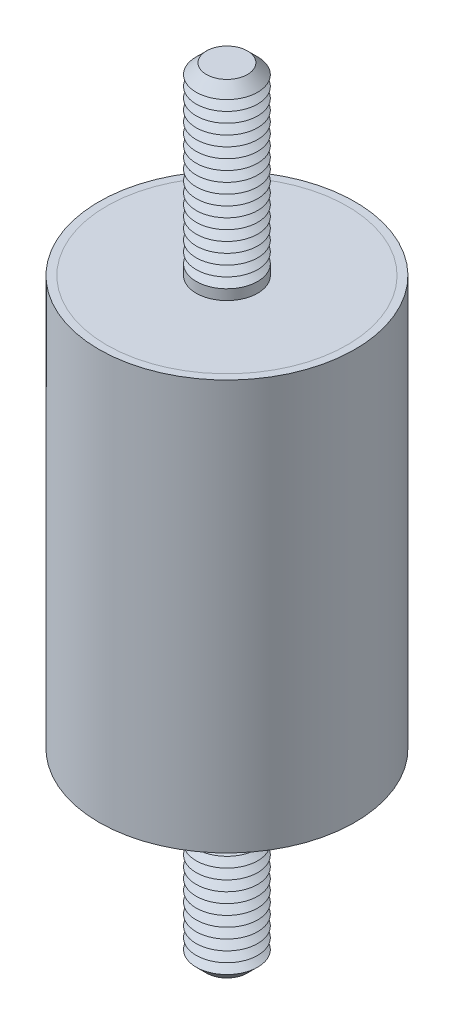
ISO-10303-21;
HEADER;
FILE_DESCRIPTION(('STEP AP214'),'2;1');
FILE_NAME('part.step','',(''),(''),'','','');
FILE_SCHEMA(('AUTOMOTIVE_DESIGN { 1 0 10303 214 1 1 1 1 }'));
ENDSEC;
DATA;
#1=APPLICATION_CONTEXT('core data for automotive mechanical design processes');
#2=APPLICATION_PROTOCOL_DEFINITION('international standard','automotive_design',2000,#1);
#3=PRODUCT_CONTEXT('',#1,'mechanical');
#4=PRODUCT('Part','Part','',(#3));
#5=PRODUCT_RELATED_PRODUCT_CATEGORY('part','',(#4));
#6=PRODUCT_DEFINITION_FORMATION('','',#4);
#7=PRODUCT_DEFINITION_CONTEXT('part definition',#1,'design');
#8=PRODUCT_DEFINITION('design','',#6,#7);
#9=PRODUCT_DEFINITION_SHAPE('','',#8);
#10=(LENGTH_UNIT() NAMED_UNIT(*) SI_UNIT(.MILLI.,.METRE.));
#11=(NAMED_UNIT(*) PLANE_ANGLE_UNIT() SI_UNIT($,.RADIAN.));
#12=(NAMED_UNIT(*) SI_UNIT($,.STERADIAN.) SOLID_ANGLE_UNIT());
#13=UNCERTAINTY_MEASURE_WITH_UNIT(LENGTH_MEASURE(1.E-05),#10,'distance_accuracy_value','');
#14=(GEOMETRIC_REPRESENTATION_CONTEXT(3) GLOBAL_UNCERTAINTY_ASSIGNED_CONTEXT((#13)) GLOBAL_UNIT_ASSIGNED_CONTEXT((#10,
#11,#12)) REPRESENTATION_CONTEXT('',''));
#15=CARTESIAN_POINT('',(0.,0.,0.));
#16=DIRECTION('',(0.,0.,1.));
#17=DIRECTION('',(1.,0.,0.));
#18=AXIS2_PLACEMENT_3D('',#15,#16,#17);
#19=CARTESIAN_POINT('',(0.,-38.,0.));
#20=DIRECTION('',(0.,1.,0.));
#21=DIRECTION('',(0.,0.,1.));
#22=AXIS2_PLACEMENT_3D('',#19,#20,#21);
#23=CYLINDRICAL_SURFACE('',#22,3.);
#24=CARTESIAN_POINT('',(0.,-20.,0.));
#25=DIRECTION('',(0.,-1.,0.));
#26=DIRECTION('',(0.,0.,-1.));
#27=AXIS2_PLACEMENT_3D('',#24,#25,#26);
#28=CIRCLE('',#27,3.);
#29=CARTESIAN_POINT('',(0.,-20.,-3.));
#30=VERTEX_POINT('',#29);
#31=EDGE_CURVE('P0_E21',#30,#30,#28,.T.);
#32=ORIENTED_EDGE('',*,*,#31,.T.);
#33=EDGE_LOOP('',(#32));
#34=FACE_BOUND('',#33,.T.);
#35=CARTESIAN_POINT('',(0.,-21.,0.));
#36=DIRECTION('',(0.,1.,0.));
#37=DIRECTION('',(0.,0.,1.));
#38=AXIS2_PLACEMENT_3D('',#35,#36,#37);
#39=CIRCLE('',#38,3.);
#40=CARTESIAN_POINT('',(0.,-21.,3.));
#41=VERTEX_POINT('',#40);
#42=EDGE_CURVE('P0_E33',#41,#41,#39,.T.);
#43=ORIENTED_EDGE('',*,*,#42,.T.);
#44=EDGE_LOOP('',(#43));
#45=FACE_BOUND('',#44,.T.);
#46=ADVANCED_FACE('P0_F14',(#34,#45),#23,.T.);
#47=CARTESIAN_POINT('',(0.,-20.,0.));
#48=DIRECTION('',(0.,1.,0.));
#49=DIRECTION('',(0.,0.,1.));
#50=AXIS2_PLACEMENT_3D('',#47,#48,#49);
#51=CYLINDRICAL_SURFACE('',#50,11.75);
#52=CARTESIAN_POINT('',(0.,-20.,0.));
#53=DIRECTION('',(0.,1.,0.));
#54=DIRECTION('',(0.,0.,1.));
#55=AXIS2_PLACEMENT_3D('',#52,#53,#54);
#56=CIRCLE('',#55,11.75);
#57=CARTESIAN_POINT('',(0.,-20.,11.75));
#58=VERTEX_POINT('',#57);
#59=EDGE_CURVE('P0_E25',#58,#58,#56,.T.);
#60=ORIENTED_EDGE('',*,*,#59,.T.);
#61=EDGE_LOOP('',(#60));
#62=FACE_BOUND('',#61,.T.);
#63=CARTESIAN_POINT('',(0.,-18.5,0.));
#64=DIRECTION('',(0.,1.,0.));
#65=DIRECTION('',(0.,0.,1.));
#66=AXIS2_PLACEMENT_3D('',#63,#64,#65);
#67=CIRCLE('',#66,11.75);
#68=CARTESIAN_POINT('',(0.,-18.5,11.75));
#69=VERTEX_POINT('',#68);
#70=EDGE_CURVE('P0_E30',#69,#69,#67,.T.);
#71=ORIENTED_EDGE('',*,*,#70,.F.);
#72=EDGE_LOOP('',(#71));
#73=FACE_BOUND('',#72,.T.);
#74=ADVANCED_FACE('P0_F157',(#62,#73),#51,.T.);
#75=CARTESIAN_POINT('',(0.,-20.,0.));
#76=DIRECTION('',(0.,1.,0.));
#77=DIRECTION('',(0.,0.,1.));
#78=AXIS2_PLACEMENT_3D('',#75,#76,#77);
#79=PLANE('',#78);
#80=ORIENTED_EDGE('',*,*,#31,.F.);
#81=EDGE_LOOP('',(#80));
#82=FACE_BOUND('',#81,.T.);
#83=ORIENTED_EDGE('',*,*,#59,.F.);
#84=EDGE_LOOP('',(#83));
#85=FACE_BOUND('',#84,.T.);
#86=ADVANCED_FACE('P0_F162',(#82,#85),#79,.F.);
#87=CARTESIAN_POINT('',(0.,-18.5,0.));
#88=DIRECTION('',(0.,1.,0.));
#89=DIRECTION('',(0.,0.,1.));
#90=AXIS2_PLACEMENT_3D('',#87,#88,#89);
#91=PLANE('',#90);
#92=ORIENTED_EDGE('',*,*,#70,.T.);
#93=EDGE_LOOP('',(#92));
#94=FACE_BOUND('',#93,.T.);
#95=ADVANCED_FACE('P0_F168',(#94),#91,.T.);
#96=CARTESIAN_POINT('',(0.,-21.,0.));
#97=DIRECTION('',(0.,1.,0.));
#98=DIRECTION('',(0.,0.,1.));
#99=AXIS2_PLACEMENT_3D('',#96,#97,#98);
#100=CONICAL_SURFACE('',#99,3.,1.0471975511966);
#101=CARTESIAN_POINT('',(0.,-21.5,0.));
#102=DIRECTION('',(0.,1.,0.));
#103=DIRECTION('',(0.,0.,1.));
#104=AXIS2_PLACEMENT_3D('',#101,#102,#103);
#105=CIRCLE('',#104,2.13397459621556);
#106=CARTESIAN_POINT('',(0.,-21.5,2.13397459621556));
#107=VERTEX_POINT('',#106);
#108=EDGE_CURVE('P0_E39',#107,#107,#105,.T.);
#109=ORIENTED_EDGE('',*,*,#108,.T.);
#110=EDGE_LOOP('',(#109));
#111=FACE_BOUND('',#110,.T.);
#112=ORIENTED_EDGE('',*,*,#42,.F.);
#113=EDGE_LOOP('',(#112));
#114=FACE_BOUND('',#113,.T.);
#115=ADVANCED_FACE('P0_F171',(#111,#114),#100,.T.);
#116=CARTESIAN_POINT('',(0.,-21.5,0.));
#117=DIRECTION('',(0.,-1.,0.));
#118=DIRECTION('',(0.,0.,-1.));
#119=AXIS2_PLACEMENT_3D('',#116,#117,#118);
#120=CONICAL_SURFACE('',#119,2.13397459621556,1.0471975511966);
#121=CARTESIAN_POINT('',(0.,-22.,0.));
#122=DIRECTION('',(0.,1.,0.));
#123=DIRECTION('',(0.,0.,1.));
#124=AXIS2_PLACEMENT_3D('',#121,#122,#123);
#125=CIRCLE('',#124,3.);
#126=CARTESIAN_POINT('',(0.,-22.,3.));
#127=VERTEX_POINT('',#126);
#128=EDGE_CURVE('P0_E43',#127,#127,#125,.T.);
#129=ORIENTED_EDGE('',*,*,#128,.T.);
#130=EDGE_LOOP('',(#129));
#131=FACE_BOUND('',#130,.T.);
#132=ORIENTED_EDGE('',*,*,#108,.F.);
#133=EDGE_LOOP('',(#132));
#134=FACE_BOUND('',#133,.T.);
#135=ADVANCED_FACE('P0_F175',(#131,#134),#120,.T.);
#136=CARTESIAN_POINT('',(0.,-22.,0.));
#137=DIRECTION('',(0.,1.,0.));
#138=DIRECTION('',(0.,0.,1.));
#139=AXIS2_PLACEMENT_3D('',#136,#137,#138);
#140=CONICAL_SURFACE('',#139,3.,1.0471975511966);
#141=CARTESIAN_POINT('',(0.,-22.5,0.));
#142=DIRECTION('',(0.,1.,0.));
#143=DIRECTION('',(0.,0.,1.));
#144=AXIS2_PLACEMENT_3D('',#141,#142,#143);
#145=CIRCLE('',#144,2.13397459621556);
#146=CARTESIAN_POINT('',(0.,-22.5,2.13397459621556));
#147=VERTEX_POINT('',#146);
#148=EDGE_CURVE('P0_E47',#147,#147,#145,.T.);
#149=ORIENTED_EDGE('',*,*,#148,.T.);
#150=EDGE_LOOP('',(#149));
#151=FACE_BOUND('',#150,.T.);
#152=ORIENTED_EDGE('',*,*,#128,.F.);
#153=EDGE_LOOP('',(#152));
#154=FACE_BOUND('',#153,.T.);
#155=ADVANCED_FACE('P0_F179',(#151,#154),#140,.T.);
#156=CARTESIAN_POINT('',(0.,-22.5,0.));
#157=DIRECTION('',(0.,-1.,0.));
#158=DIRECTION('',(0.,0.,-1.));
#159=AXIS2_PLACEMENT_3D('',#156,#157,#158);
#160=CONICAL_SURFACE('',#159,2.13397459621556,1.0471975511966);
#161=CARTESIAN_POINT('',(0.,-23.,0.));
#162=DIRECTION('',(0.,1.,0.));
#163=DIRECTION('',(0.,0.,1.));
#164=AXIS2_PLACEMENT_3D('',#161,#162,#163);
#165=CIRCLE('',#164,3.);
#166=CARTESIAN_POINT('',(0.,-23.,3.));
#167=VERTEX_POINT('',#166);
#168=EDGE_CURVE('P0_E52',#167,#167,#165,.T.);
#169=ORIENTED_EDGE('',*,*,#168,.T.);
#170=EDGE_LOOP('',(#169));
#171=FACE_BOUND('',#170,.T.);
#172=ORIENTED_EDGE('',*,*,#148,.F.);
#173=EDGE_LOOP('',(#172));
#174=FACE_BOUND('',#173,.T.);
#175=ADVANCED_FACE('P0_F186',(#171,#174),#160,.T.);
#176=CARTESIAN_POINT('',(0.,-23.,0.));
#177=DIRECTION('',(0.,1.,0.));
#178=DIRECTION('',(0.,0.,1.));
#179=AXIS2_PLACEMENT_3D('',#176,#177,#178);
#180=CONICAL_SURFACE('',#179,3.,1.0471975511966);
#181=CARTESIAN_POINT('',(0.,-23.5,0.));
#182=DIRECTION('',(0.,1.,0.));
#183=DIRECTION('',(0.,0.,1.));
#184=AXIS2_PLACEMENT_3D('',#181,#182,#183);
#185=CIRCLE('',#184,2.13397459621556);
#186=CARTESIAN_POINT('',(0.,-23.5,2.13397459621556));
#187=VERTEX_POINT('',#186);
#188=EDGE_CURVE('P0_E55',#187,#187,#185,.T.);
#189=ORIENTED_EDGE('',*,*,#188,.T.);
#190=EDGE_LOOP('',(#189));
#191=FACE_BOUND('',#190,.T.);
#192=ORIENTED_EDGE('',*,*,#168,.F.);
#193=EDGE_LOOP('',(#192));
#194=FACE_BOUND('',#193,.T.);
#195=ADVANCED_FACE('P0_F190',(#191,#194),#180,.T.);
#196=CARTESIAN_POINT('',(0.,-23.5,0.));
#197=DIRECTION('',(0.,-1.,0.));
#198=DIRECTION('',(0.,0.,-1.));
#199=AXIS2_PLACEMENT_3D('',#196,#197,#198);
#200=CONICAL_SURFACE('',#199,2.13397459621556,1.0471975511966);
#201=CARTESIAN_POINT('',(0.,-24.,0.));
#202=DIRECTION('',(0.,1.,0.));
#203=DIRECTION('',(0.,0.,1.));
#204=AXIS2_PLACEMENT_3D('',#201,#202,#203);
#205=CIRCLE('',#204,3.);
#206=CARTESIAN_POINT('',(0.,-24.,3.));
#207=VERTEX_POINT('',#206);
#208=EDGE_CURVE('P0_E58',#207,#207,#205,.T.);
#209=ORIENTED_EDGE('',*,*,#208,.T.);
#210=EDGE_LOOP('',(#209));
#211=FACE_BOUND('',#210,.T.);
#212=ORIENTED_EDGE('',*,*,#188,.F.);
#213=EDGE_LOOP('',(#212));
#214=FACE_BOUND('',#213,.T.);
#215=ADVANCED_FACE('P0_F194',(#211,#214),#200,.T.);
#216=CARTESIAN_POINT('',(0.,-24.,0.));
#217=DIRECTION('',(0.,1.,0.));
#218=DIRECTION('',(0.,0.,1.));
#219=AXIS2_PLACEMENT_3D('',#216,#217,#218);
#220=CONICAL_SURFACE('',#219,3.,1.0471975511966);
#221=CARTESIAN_POINT('',(0.,-24.5,0.));
#222=DIRECTION('',(0.,1.,0.));
#223=DIRECTION('',(0.,0.,1.));
#224=AXIS2_PLACEMENT_3D('',#221,#222,#223);
#225=CIRCLE('',#224,2.13397459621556);
#226=CARTESIAN_POINT('',(0.,-24.5,2.13397459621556));
#227=VERTEX_POINT('',#226);
#228=EDGE_CURVE('P0_E61',#227,#227,#225,.T.);
#229=ORIENTED_EDGE('',*,*,#228,.T.);
#230=EDGE_LOOP('',(#229));
#231=FACE_BOUND('',#230,.T.);
#232=ORIENTED_EDGE('',*,*,#208,.F.);
#233=EDGE_LOOP('',(#232));
#234=FACE_BOUND('',#233,.T.);
#235=ADVANCED_FACE('P0_F198',(#231,#234),#220,.T.);
#236=CARTESIAN_POINT('',(0.,-24.5,0.));
#237=DIRECTION('',(0.,-1.,0.));
#238=DIRECTION('',(0.,0.,-1.));
#239=AXIS2_PLACEMENT_3D('',#236,#237,#238);
#240=CONICAL_SURFACE('',#239,2.13397459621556,1.0471975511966);
#241=CARTESIAN_POINT('',(0.,-25.,0.));
#242=DIRECTION('',(0.,1.,0.));
#243=DIRECTION('',(0.,0.,1.));
#244=AXIS2_PLACEMENT_3D('',#241,#242,#243);
#245=CIRCLE('',#244,3.);
#246=CARTESIAN_POINT('',(0.,-25.,3.));
#247=VERTEX_POINT('',#246);
#248=EDGE_CURVE('P0_E64',#247,#247,#245,.T.);
#249=ORIENTED_EDGE('',*,*,#248,.T.);
#250=EDGE_LOOP('',(#249));
#251=FACE_BOUND('',#250,.T.);
#252=ORIENTED_EDGE('',*,*,#228,.F.);
#253=EDGE_LOOP('',(#252));
#254=FACE_BOUND('',#253,.T.);
#255=ADVANCED_FACE('P0_F202',(#251,#254),#240,.T.);
#256=CARTESIAN_POINT('',(0.,-25.,0.));
#257=DIRECTION('',(0.,1.,0.));
#258=DIRECTION('',(0.,0.,1.));
#259=AXIS2_PLACEMENT_3D('',#256,#257,#258);
#260=CONICAL_SURFACE('',#259,3.,1.0471975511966);
#261=CARTESIAN_POINT('',(0.,-25.5,0.));
#262=DIRECTION('',(0.,1.,0.));
#263=DIRECTION('',(0.,0.,1.));
#264=AXIS2_PLACEMENT_3D('',#261,#262,#263);
#265=CIRCLE('',#264,2.13397459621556);
#266=CARTESIAN_POINT('',(0.,-25.5,2.13397459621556));
#267=VERTEX_POINT('',#266);
#268=EDGE_CURVE('P0_E67',#267,#267,#265,.T.);
#269=ORIENTED_EDGE('',*,*,#268,.T.);
#270=EDGE_LOOP('',(#269));
#271=FACE_BOUND('',#270,.T.);
#272=ORIENTED_EDGE('',*,*,#248,.F.);
#273=EDGE_LOOP('',(#272));
#274=FACE_BOUND('',#273,.T.);
#275=ADVANCED_FACE('P0_F206',(#271,#274),#260,.T.);
#276=CARTESIAN_POINT('',(0.,-25.5,0.));
#277=DIRECTION('',(0.,-1.,0.));
#278=DIRECTION('',(0.,0.,-1.));
#279=AXIS2_PLACEMENT_3D('',#276,#277,#278);
#280=CONICAL_SURFACE('',#279,2.13397459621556,1.0471975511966);
#281=CARTESIAN_POINT('',(0.,-26.,0.));
#282=DIRECTION('',(0.,1.,0.));
#283=DIRECTION('',(0.,0.,1.));
#284=AXIS2_PLACEMENT_3D('',#281,#282,#283);
#285=CIRCLE('',#284,3.);
#286=CARTESIAN_POINT('',(0.,-26.,3.));
#287=VERTEX_POINT('',#286);
#288=EDGE_CURVE('P0_E70',#287,#287,#285,.T.);
#289=ORIENTED_EDGE('',*,*,#288,.T.);
#290=EDGE_LOOP('',(#289));
#291=FACE_BOUND('',#290,.T.);
#292=ORIENTED_EDGE('',*,*,#268,.F.);
#293=EDGE_LOOP('',(#292));
#294=FACE_BOUND('',#293,.T.);
#295=ADVANCED_FACE('P0_F210',(#291,#294),#280,.T.);
#296=CARTESIAN_POINT('',(0.,-26.,0.));
#297=DIRECTION('',(0.,1.,0.));
#298=DIRECTION('',(0.,0.,1.));
#299=AXIS2_PLACEMENT_3D('',#296,#297,#298);
#300=CONICAL_SURFACE('',#299,3.,1.0471975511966);
#301=CARTESIAN_POINT('',(0.,-26.5,0.));
#302=DIRECTION('',(0.,1.,0.));
#303=DIRECTION('',(0.,0.,1.));
#304=AXIS2_PLACEMENT_3D('',#301,#302,#303);
#305=CIRCLE('',#304,2.13397459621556);
#306=CARTESIAN_POINT('',(0.,-26.5,2.13397459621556));
#307=VERTEX_POINT('',#306);
#308=EDGE_CURVE('P0_E73',#307,#307,#305,.T.);
#309=ORIENTED_EDGE('',*,*,#308,.T.);
#310=EDGE_LOOP('',(#309));
#311=FACE_BOUND('',#310,.T.);
#312=ORIENTED_EDGE('',*,*,#288,.F.);
#313=EDGE_LOOP('',(#312));
#314=FACE_BOUND('',#313,.T.);
#315=ADVANCED_FACE('P0_F214',(#311,#314),#300,.T.);
#316=CARTESIAN_POINT('',(0.,-26.5,0.));
#317=DIRECTION('',(0.,-1.,0.));
#318=DIRECTION('',(0.,0.,-1.));
#319=AXIS2_PLACEMENT_3D('',#316,#317,#318);
#320=CONICAL_SURFACE('',#319,2.13397459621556,1.0471975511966);
#321=CARTESIAN_POINT('',(0.,-27.,0.));
#322=DIRECTION('',(0.,1.,0.));
#323=DIRECTION('',(0.,0.,1.));
#324=AXIS2_PLACEMENT_3D('',#321,#322,#323);
#325=CIRCLE('',#324,3.);
#326=CARTESIAN_POINT('',(0.,-27.,3.));
#327=VERTEX_POINT('',#326);
#328=EDGE_CURVE('P0_E76',#327,#327,#325,.T.);
#329=ORIENTED_EDGE('',*,*,#328,.T.);
#330=EDGE_LOOP('',(#329));
#331=FACE_BOUND('',#330,.T.);
#332=ORIENTED_EDGE('',*,*,#308,.F.);
#333=EDGE_LOOP('',(#332));
#334=FACE_BOUND('',#333,.T.);
#335=ADVANCED_FACE('P0_F218',(#331,#334),#320,.T.);
#336=CARTESIAN_POINT('',(0.,-27.,0.));
#337=DIRECTION('',(0.,1.,0.));
#338=DIRECTION('',(0.,0.,1.));
#339=AXIS2_PLACEMENT_3D('',#336,#337,#338);
#340=CONICAL_SURFACE('',#339,3.,1.0471975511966);
#341=CARTESIAN_POINT('',(0.,-27.5,0.));
#342=DIRECTION('',(0.,1.,0.));
#343=DIRECTION('',(0.,0.,1.));
#344=AXIS2_PLACEMENT_3D('',#341,#342,#343);
#345=CIRCLE('',#344,2.13397459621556);
#346=CARTESIAN_POINT('',(0.,-27.5,2.13397459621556));
#347=VERTEX_POINT('',#346);
#348=EDGE_CURVE('P0_E79',#347,#347,#345,.T.);
#349=ORIENTED_EDGE('',*,*,#348,.T.);
#350=EDGE_LOOP('',(#349));
#351=FACE_BOUND('',#350,.T.);
#352=ORIENTED_EDGE('',*,*,#328,.F.);
#353=EDGE_LOOP('',(#352));
#354=FACE_BOUND('',#353,.T.);
#355=ADVANCED_FACE('P0_F222',(#351,#354),#340,.T.);
#356=CARTESIAN_POINT('',(0.,-27.5,0.));
#357=DIRECTION('',(0.,-1.,0.));
#358=DIRECTION('',(0.,0.,-1.));
#359=AXIS2_PLACEMENT_3D('',#356,#357,#358);
#360=CONICAL_SURFACE('',#359,2.13397459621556,1.0471975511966);
#361=CARTESIAN_POINT('',(0.,-28.,0.));
#362=DIRECTION('',(0.,1.,0.));
#363=DIRECTION('',(0.,0.,1.));
#364=AXIS2_PLACEMENT_3D('',#361,#362,#363);
#365=CIRCLE('',#364,3.);
#366=CARTESIAN_POINT('',(0.,-28.,3.));
#367=VERTEX_POINT('',#366);
#368=EDGE_CURVE('P0_E82',#367,#367,#365,.T.);
#369=ORIENTED_EDGE('',*,*,#368,.T.);
#370=EDGE_LOOP('',(#369));
#371=FACE_BOUND('',#370,.T.);
#372=ORIENTED_EDGE('',*,*,#348,.F.);
#373=EDGE_LOOP('',(#372));
#374=FACE_BOUND('',#373,.T.);
#375=ADVANCED_FACE('P0_F226',(#371,#374),#360,.T.);
#376=CARTESIAN_POINT('',(0.,-28.,0.));
#377=DIRECTION('',(0.,1.,0.));
#378=DIRECTION('',(0.,0.,1.));
#379=AXIS2_PLACEMENT_3D('',#376,#377,#378);
#380=CONICAL_SURFACE('',#379,3.,1.0471975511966);
#381=CARTESIAN_POINT('',(0.,-28.5,0.));
#382=DIRECTION('',(0.,1.,0.));
#383=DIRECTION('',(0.,0.,1.));
#384=AXIS2_PLACEMENT_3D('',#381,#382,#383);
#385=CIRCLE('',#384,2.13397459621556);
#386=CARTESIAN_POINT('',(0.,-28.5,2.13397459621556));
#387=VERTEX_POINT('',#386);
#388=EDGE_CURVE('P0_E85',#387,#387,#385,.T.);
#389=ORIENTED_EDGE('',*,*,#388,.T.);
#390=EDGE_LOOP('',(#389));
#391=FACE_BOUND('',#390,.T.);
#392=ORIENTED_EDGE('',*,*,#368,.F.);
#393=EDGE_LOOP('',(#392));
#394=FACE_BOUND('',#393,.T.);
#395=ADVANCED_FACE('P0_F230',(#391,#394),#380,.T.);
#396=CARTESIAN_POINT('',(0.,-28.5,0.));
#397=DIRECTION('',(0.,-1.,0.));
#398=DIRECTION('',(0.,0.,-1.));
#399=AXIS2_PLACEMENT_3D('',#396,#397,#398);
#400=CONICAL_SURFACE('',#399,2.13397459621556,1.0471975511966);
#401=CARTESIAN_POINT('',(0.,-29.,0.));
#402=DIRECTION('',(0.,1.,0.));
#403=DIRECTION('',(0.,0.,1.));
#404=AXIS2_PLACEMENT_3D('',#401,#402,#403);
#405=CIRCLE('',#404,3.);
#406=CARTESIAN_POINT('',(0.,-29.,3.));
#407=VERTEX_POINT('',#406);
#408=EDGE_CURVE('P0_E88',#407,#407,#405,.T.);
#409=ORIENTED_EDGE('',*,*,#408,.T.);
#410=EDGE_LOOP('',(#409));
#411=FACE_BOUND('',#410,.T.);
#412=ORIENTED_EDGE('',*,*,#388,.F.);
#413=EDGE_LOOP('',(#412));
#414=FACE_BOUND('',#413,.T.);
#415=ADVANCED_FACE('P0_F234',(#411,#414),#400,.T.);
#416=CARTESIAN_POINT('',(0.,-29.,0.));
#417=DIRECTION('',(0.,1.,0.));
#418=DIRECTION('',(0.,0.,1.));
#419=AXIS2_PLACEMENT_3D('',#416,#417,#418);
#420=CONICAL_SURFACE('',#419,3.,1.0471975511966);
#421=CARTESIAN_POINT('',(0.,-29.5,0.));
#422=DIRECTION('',(0.,1.,0.));
#423=DIRECTION('',(0.,0.,1.));
#424=AXIS2_PLACEMENT_3D('',#421,#422,#423);
#425=CIRCLE('',#424,2.13397459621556);
#426=CARTESIAN_POINT('',(0.,-29.5,2.13397459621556));
#427=VERTEX_POINT('',#426);
#428=EDGE_CURVE('P0_E91',#427,#427,#425,.T.);
#429=ORIENTED_EDGE('',*,*,#428,.T.);
#430=EDGE_LOOP('',(#429));
#431=FACE_BOUND('',#430,.T.);
#432=ORIENTED_EDGE('',*,*,#408,.F.);
#433=EDGE_LOOP('',(#432));
#434=FACE_BOUND('',#433,.T.);
#435=ADVANCED_FACE('P0_F238',(#431,#434),#420,.T.);
#436=CARTESIAN_POINT('',(0.,-29.5,0.));
#437=DIRECTION('',(0.,-1.,0.));
#438=DIRECTION('',(0.,0.,-1.));
#439=AXIS2_PLACEMENT_3D('',#436,#437,#438);
#440=CONICAL_SURFACE('',#439,2.13397459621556,1.0471975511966);
#441=CARTESIAN_POINT('',(0.,-30.,0.));
#442=DIRECTION('',(0.,1.,0.));
#443=DIRECTION('',(0.,0.,1.));
#444=AXIS2_PLACEMENT_3D('',#441,#442,#443);
#445=CIRCLE('',#444,3.);
#446=CARTESIAN_POINT('',(0.,-30.,3.));
#447=VERTEX_POINT('',#446);
#448=EDGE_CURVE('P0_E94',#447,#447,#445,.T.);
#449=ORIENTED_EDGE('',*,*,#448,.T.);
#450=EDGE_LOOP('',(#449));
#451=FACE_BOUND('',#450,.T.);
#452=ORIENTED_EDGE('',*,*,#428,.F.);
#453=EDGE_LOOP('',(#452));
#454=FACE_BOUND('',#453,.T.);
#455=ADVANCED_FACE('P0_F242',(#451,#454),#440,.T.);
#456=CARTESIAN_POINT('',(0.,-30.,0.));
#457=DIRECTION('',(0.,1.,0.));
#458=DIRECTION('',(0.,0.,1.));
#459=AXIS2_PLACEMENT_3D('',#456,#457,#458);
#460=CONICAL_SURFACE('',#459,3.,1.0471975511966);
#461=CARTESIAN_POINT('',(0.,-30.5,0.));
#462=DIRECTION('',(0.,1.,0.));
#463=DIRECTION('',(0.,0.,1.));
#464=AXIS2_PLACEMENT_3D('',#461,#462,#463);
#465=CIRCLE('',#464,2.13397459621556);
#466=CARTESIAN_POINT('',(0.,-30.5,2.13397459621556));
#467=VERTEX_POINT('',#466);
#468=EDGE_CURVE('P0_E97',#467,#467,#465,.T.);
#469=ORIENTED_EDGE('',*,*,#468,.T.);
#470=EDGE_LOOP('',(#469));
#471=FACE_BOUND('',#470,.T.);
#472=ORIENTED_EDGE('',*,*,#448,.F.);
#473=EDGE_LOOP('',(#472));
#474=FACE_BOUND('',#473,.T.);
#475=ADVANCED_FACE('P0_F246',(#471,#474),#460,.T.);
#476=CARTESIAN_POINT('',(0.,-30.5,0.));
#477=DIRECTION('',(0.,-1.,0.));
#478=DIRECTION('',(0.,0.,-1.));
#479=AXIS2_PLACEMENT_3D('',#476,#477,#478);
#480=CONICAL_SURFACE('',#479,2.13397459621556,1.0471975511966);
#481=CARTESIAN_POINT('',(0.,-31.,0.));
#482=DIRECTION('',(0.,1.,0.));
#483=DIRECTION('',(0.,0.,1.));
#484=AXIS2_PLACEMENT_3D('',#481,#482,#483);
#485=CIRCLE('',#484,3.);
#486=CARTESIAN_POINT('',(0.,-31.,3.));
#487=VERTEX_POINT('',#486);
#488=EDGE_CURVE('P0_E100',#487,#487,#485,.T.);
#489=ORIENTED_EDGE('',*,*,#488,.T.);
#490=EDGE_LOOP('',(#489));
#491=FACE_BOUND('',#490,.T.);
#492=ORIENTED_EDGE('',*,*,#468,.F.);
#493=EDGE_LOOP('',(#492));
#494=FACE_BOUND('',#493,.T.);
#495=ADVANCED_FACE('P0_F250',(#491,#494),#480,.T.);
#496=CARTESIAN_POINT('',(0.,-31.,0.));
#497=DIRECTION('',(0.,1.,0.));
#498=DIRECTION('',(0.,0.,1.));
#499=AXIS2_PLACEMENT_3D('',#496,#497,#498);
#500=CONICAL_SURFACE('',#499,3.,1.0471975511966);
#501=CARTESIAN_POINT('',(0.,-31.5,0.));
#502=DIRECTION('',(0.,1.,0.));
#503=DIRECTION('',(0.,0.,1.));
#504=AXIS2_PLACEMENT_3D('',#501,#502,#503);
#505=CIRCLE('',#504,2.13397459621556);
#506=CARTESIAN_POINT('',(0.,-31.5,2.13397459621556));
#507=VERTEX_POINT('',#506);
#508=EDGE_CURVE('P0_E103',#507,#507,#505,.T.);
#509=ORIENTED_EDGE('',*,*,#508,.T.);
#510=EDGE_LOOP('',(#509));
#511=FACE_BOUND('',#510,.T.);
#512=ORIENTED_EDGE('',*,*,#488,.F.);
#513=EDGE_LOOP('',(#512));
#514=FACE_BOUND('',#513,.T.);
#515=ADVANCED_FACE('P0_F254',(#511,#514),#500,.T.);
#516=CARTESIAN_POINT('',(0.,-31.5,0.));
#517=DIRECTION('',(0.,-1.,0.));
#518=DIRECTION('',(0.,0.,-1.));
#519=AXIS2_PLACEMENT_3D('',#516,#517,#518);
#520=CONICAL_SURFACE('',#519,2.13397459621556,1.0471975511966);
#521=CARTESIAN_POINT('',(0.,-32.,0.));
#522=DIRECTION('',(0.,1.,0.));
#523=DIRECTION('',(0.,0.,1.));
#524=AXIS2_PLACEMENT_3D('',#521,#522,#523);
#525=CIRCLE('',#524,3.);
#526=CARTESIAN_POINT('',(0.,-32.,3.));
#527=VERTEX_POINT('',#526);
#528=EDGE_CURVE('P0_E106',#527,#527,#525,.T.);
#529=ORIENTED_EDGE('',*,*,#528,.T.);
#530=EDGE_LOOP('',(#529));
#531=FACE_BOUND('',#530,.T.);
#532=ORIENTED_EDGE('',*,*,#508,.F.);
#533=EDGE_LOOP('',(#532));
#534=FACE_BOUND('',#533,.T.);
#535=ADVANCED_FACE('P0_F258',(#531,#534),#520,.T.);
#536=CARTESIAN_POINT('',(0.,-32.,0.));
#537=DIRECTION('',(0.,1.,0.));
#538=DIRECTION('',(0.,0.,1.));
#539=AXIS2_PLACEMENT_3D('',#536,#537,#538);
#540=CONICAL_SURFACE('',#539,3.,1.0471975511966);
#541=CARTESIAN_POINT('',(0.,-32.5,0.));
#542=DIRECTION('',(0.,1.,0.));
#543=DIRECTION('',(0.,0.,1.));
#544=AXIS2_PLACEMENT_3D('',#541,#542,#543);
#545=CIRCLE('',#544,2.13397459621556);
#546=CARTESIAN_POINT('',(0.,-32.5,2.13397459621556));
#547=VERTEX_POINT('',#546);
#548=EDGE_CURVE('P0_E109',#547,#547,#545,.T.);
#549=ORIENTED_EDGE('',*,*,#548,.T.);
#550=EDGE_LOOP('',(#549));
#551=FACE_BOUND('',#550,.T.);
#552=ORIENTED_EDGE('',*,*,#528,.F.);
#553=EDGE_LOOP('',(#552));
#554=FACE_BOUND('',#553,.T.);
#555=ADVANCED_FACE('P0_F262',(#551,#554),#540,.T.);
#556=CARTESIAN_POINT('',(0.,-32.5,0.));
#557=DIRECTION('',(0.,-1.,0.));
#558=DIRECTION('',(0.,0.,-1.));
#559=AXIS2_PLACEMENT_3D('',#556,#557,#558);
#560=CONICAL_SURFACE('',#559,2.13397459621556,1.0471975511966);
#561=CARTESIAN_POINT('',(0.,-33.,0.));
#562=DIRECTION('',(0.,1.,0.));
#563=DIRECTION('',(0.,0.,1.));
#564=AXIS2_PLACEMENT_3D('',#561,#562,#563);
#565=CIRCLE('',#564,3.);
#566=CARTESIAN_POINT('',(0.,-33.,3.));
#567=VERTEX_POINT('',#566);
#568=EDGE_CURVE('P0_E112',#567,#567,#565,.T.);
#569=ORIENTED_EDGE('',*,*,#568,.T.);
#570=EDGE_LOOP('',(#569));
#571=FACE_BOUND('',#570,.T.);
#572=ORIENTED_EDGE('',*,*,#548,.F.);
#573=EDGE_LOOP('',(#572));
#574=FACE_BOUND('',#573,.T.);
#575=ADVANCED_FACE('P0_F266',(#571,#574),#560,.T.);
#576=CARTESIAN_POINT('',(0.,-33.,0.));
#577=DIRECTION('',(0.,1.,0.));
#578=DIRECTION('',(0.,0.,1.));
#579=AXIS2_PLACEMENT_3D('',#576,#577,#578);
#580=CONICAL_SURFACE('',#579,3.,1.0471975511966);
#581=CARTESIAN_POINT('',(0.,-33.5,0.));
#582=DIRECTION('',(0.,1.,0.));
#583=DIRECTION('',(0.,0.,1.));
#584=AXIS2_PLACEMENT_3D('',#581,#582,#583);
#585=CIRCLE('',#584,2.13397459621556);
#586=CARTESIAN_POINT('',(0.,-33.5,2.13397459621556));
#587=VERTEX_POINT('',#586);
#588=EDGE_CURVE('P0_E115',#587,#587,#585,.T.);
#589=ORIENTED_EDGE('',*,*,#588,.T.);
#590=EDGE_LOOP('',(#589));
#591=FACE_BOUND('',#590,.T.);
#592=ORIENTED_EDGE('',*,*,#568,.F.);
#593=EDGE_LOOP('',(#592));
#594=FACE_BOUND('',#593,.T.);
#595=ADVANCED_FACE('P0_F270',(#591,#594),#580,.T.);
#596=CARTESIAN_POINT('',(0.,-33.5,0.));
#597=DIRECTION('',(0.,-1.,0.));
#598=DIRECTION('',(0.,0.,-1.));
#599=AXIS2_PLACEMENT_3D('',#596,#597,#598);
#600=CONICAL_SURFACE('',#599,2.13397459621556,1.0471975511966);
#601=CARTESIAN_POINT('',(0.,-34.,0.));
#602=DIRECTION('',(0.,1.,0.));
#603=DIRECTION('',(0.,0.,1.));
#604=AXIS2_PLACEMENT_3D('',#601,#602,#603);
#605=CIRCLE('',#604,3.);
#606=CARTESIAN_POINT('',(0.,-34.,3.));
#607=VERTEX_POINT('',#606);
#608=EDGE_CURVE('P0_E118',#607,#607,#605,.T.);
#609=ORIENTED_EDGE('',*,*,#608,.T.);
#610=EDGE_LOOP('',(#609));
#611=FACE_BOUND('',#610,.T.);
#612=ORIENTED_EDGE('',*,*,#588,.F.);
#613=EDGE_LOOP('',(#612));
#614=FACE_BOUND('',#613,.T.);
#615=ADVANCED_FACE('P0_F274',(#611,#614),#600,.T.);
#616=CARTESIAN_POINT('',(0.,-34.,0.));
#617=DIRECTION('',(0.,1.,0.));
#618=DIRECTION('',(0.,0.,1.));
#619=AXIS2_PLACEMENT_3D('',#616,#617,#618);
#620=CONICAL_SURFACE('',#619,3.,1.0471975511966);
#621=CARTESIAN_POINT('',(0.,-34.5,0.));
#622=DIRECTION('',(0.,1.,0.));
#623=DIRECTION('',(0.,0.,1.));
#624=AXIS2_PLACEMENT_3D('',#621,#622,#623);
#625=CIRCLE('',#624,2.13397459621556);
#626=CARTESIAN_POINT('',(0.,-34.5,2.13397459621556));
#627=VERTEX_POINT('',#626);
#628=EDGE_CURVE('P0_E121',#627,#627,#625,.T.);
#629=ORIENTED_EDGE('',*,*,#628,.T.);
#630=EDGE_LOOP('',(#629));
#631=FACE_BOUND('',#630,.T.);
#632=ORIENTED_EDGE('',*,*,#608,.F.);
#633=EDGE_LOOP('',(#632));
#634=FACE_BOUND('',#633,.T.);
#635=ADVANCED_FACE('P0_F278',(#631,#634),#620,.T.);
#636=CARTESIAN_POINT('',(0.,-34.5,0.));
#637=DIRECTION('',(0.,-1.,0.));
#638=DIRECTION('',(0.,0.,-1.));
#639=AXIS2_PLACEMENT_3D('',#636,#637,#638);
#640=CONICAL_SURFACE('',#639,2.13397459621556,1.0471975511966);
#641=CARTESIAN_POINT('',(0.,-35.,0.));
#642=DIRECTION('',(0.,1.,0.));
#643=DIRECTION('',(0.,0.,1.));
#644=AXIS2_PLACEMENT_3D('',#641,#642,#643);
#645=CIRCLE('',#644,3.);
#646=CARTESIAN_POINT('',(0.,-35.,3.));
#647=VERTEX_POINT('',#646);
#648=EDGE_CURVE('P0_E124',#647,#647,#645,.T.);
#649=ORIENTED_EDGE('',*,*,#648,.T.);
#650=EDGE_LOOP('',(#649));
#651=FACE_BOUND('',#650,.T.);
#652=ORIENTED_EDGE('',*,*,#628,.F.);
#653=EDGE_LOOP('',(#652));
#654=FACE_BOUND('',#653,.T.);
#655=ADVANCED_FACE('P0_F282',(#651,#654),#640,.T.);
#656=CARTESIAN_POINT('',(0.,-35.,0.));
#657=DIRECTION('',(0.,1.,0.));
#658=DIRECTION('',(0.,0.,1.));
#659=AXIS2_PLACEMENT_3D('',#656,#657,#658);
#660=CONICAL_SURFACE('',#659,3.,1.0471975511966);
#661=CARTESIAN_POINT('',(0.,-35.5,0.));
#662=DIRECTION('',(0.,1.,0.));
#663=DIRECTION('',(0.,0.,1.));
#664=AXIS2_PLACEMENT_3D('',#661,#662,#663);
#665=CIRCLE('',#664,2.13397459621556);
#666=CARTESIAN_POINT('',(0.,-35.5,2.13397459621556));
#667=VERTEX_POINT('',#666);
#668=EDGE_CURVE('P0_E127',#667,#667,#665,.T.);
#669=ORIENTED_EDGE('',*,*,#668,.T.);
#670=EDGE_LOOP('',(#669));
#671=FACE_BOUND('',#670,.T.);
#672=ORIENTED_EDGE('',*,*,#648,.F.);
#673=EDGE_LOOP('',(#672));
#674=FACE_BOUND('',#673,.T.);
#675=ADVANCED_FACE('P0_F286',(#671,#674),#660,.T.);
#676=CARTESIAN_POINT('',(0.,-35.5,0.));
#677=DIRECTION('',(0.,-1.,0.));
#678=DIRECTION('',(0.,0.,-1.));
#679=AXIS2_PLACEMENT_3D('',#676,#677,#678);
#680=CONICAL_SURFACE('',#679,2.13397459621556,1.0471975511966);
#681=CARTESIAN_POINT('',(0.,-36.,0.));
#682=DIRECTION('',(0.,1.,0.));
#683=DIRECTION('',(0.,0.,1.));
#684=AXIS2_PLACEMENT_3D('',#681,#682,#683);
#685=CIRCLE('',#684,3.);
#686=CARTESIAN_POINT('',(0.,-36.,3.));
#687=VERTEX_POINT('',#686);
#688=EDGE_CURVE('P0_E130',#687,#687,#685,.T.);
#689=ORIENTED_EDGE('',*,*,#688,.T.);
#690=EDGE_LOOP('',(#689));
#691=FACE_BOUND('',#690,.T.);
#692=ORIENTED_EDGE('',*,*,#668,.F.);
#693=EDGE_LOOP('',(#692));
#694=FACE_BOUND('',#693,.T.);
#695=ADVANCED_FACE('P0_F154',(#691,#694),#680,.T.);
#696=CARTESIAN_POINT('',(0.,-36.,0.));
#697=DIRECTION('',(0.,1.,0.));
#698=DIRECTION('',(0.,0.,1.));
#699=AXIS2_PLACEMENT_3D('',#696,#697,#698);
#700=CONICAL_SURFACE('',#699,3.,1.0471975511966);
#701=CARTESIAN_POINT('',(0.,-36.5,0.));
#702=DIRECTION('',(0.,1.,0.));
#703=DIRECTION('',(0.,0.,1.));
#704=AXIS2_PLACEMENT_3D('',#701,#702,#703);
#705=CIRCLE('',#704,2.13397459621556);
#706=CARTESIAN_POINT('',(0.,-36.5,2.13397459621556));
#707=VERTEX_POINT('',#706);
#708=EDGE_CURVE('P0_E136',#707,#707,#705,.T.);
#709=ORIENTED_EDGE('',*,*,#708,.T.);
#710=EDGE_LOOP('',(#709));
#711=FACE_BOUND('',#710,.T.);
#712=ORIENTED_EDGE('',*,*,#688,.F.);
#713=EDGE_LOOP('',(#712));
#714=FACE_BOUND('',#713,.T.);
#715=ADVANCED_FACE('P0_F140',(#711,#714),#700,.T.);
#716=CARTESIAN_POINT('',(0.,-36.5,0.));
#717=DIRECTION('',(0.,-1.,0.));
#718=DIRECTION('',(0.,0.,-1.));
#719=AXIS2_PLACEMENT_3D('',#716,#717,#718);
#720=CONICAL_SURFACE('',#719,2.13397459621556,1.0471975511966);
#721=CARTESIAN_POINT('',(0.,-37.,0.));
#722=DIRECTION('',(0.,1.,0.));
#723=DIRECTION('',(0.,0.,1.));
#724=AXIS2_PLACEMENT_3D('',#721,#722,#723);
#725=CIRCLE('',#724,3.);
#726=CARTESIAN_POINT('',(0.,-37.,3.));
#727=VERTEX_POINT('',#726);
#728=EDGE_CURVE('P0_E133',#727,#727,#725,.T.);
#729=ORIENTED_EDGE('',*,*,#728,.T.);
#730=EDGE_LOOP('',(#729));
#731=FACE_BOUND('',#730,.T.);
#732=ORIENTED_EDGE('',*,*,#708,.F.);
#733=EDGE_LOOP('',(#732));
#734=FACE_BOUND('',#733,.T.);
#735=ADVANCED_FACE('P0_F143',(#731,#734),#720,.T.);
#736=CARTESIAN_POINT('',(0.,-38.,0.));
#737=DIRECTION('',(0.,-1.,0.));
#738=DIRECTION('',(0.,0.,-1.));
#739=AXIS2_PLACEMENT_3D('',#736,#737,#738);
#740=PLANE('',#739);
#741=CARTESIAN_POINT('',(0.,-38.,0.));
#742=DIRECTION('',(0.,-1.,0.));
#743=DIRECTION('',(0.,0.,-1.));
#744=AXIS2_PLACEMENT_3D('',#741,#742,#743);
#745=CIRCLE('',#744,1.99999999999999);
#746=CARTESIAN_POINT('',(0.,-38.,-1.99999999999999));
#747=VERTEX_POINT('',#746);
#748=EDGE_CURVE('P0_E10',#747,#747,#745,.T.);
#749=ORIENTED_EDGE('',*,*,#748,.T.);
#750=EDGE_LOOP('',(#749));
#751=FACE_BOUND('',#750,.T.);
#752=ADVANCED_FACE('P0_F145',(#751),#740,.T.);
#753=CARTESIAN_POINT('',(0.,-38.,0.));
#754=DIRECTION('',(0.,1.,0.));
#755=DIRECTION('',(0.,0.,1.));
#756=AXIS2_PLACEMENT_3D('',#753,#754,#755);
#757=CONICAL_SURFACE('',#756,1.99999999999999,0.785398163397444);
#758=ORIENTED_EDGE('',*,*,#728,.F.);
#759=EDGE_LOOP('',(#758));
#760=FACE_BOUND('',#759,.T.);
#761=ORIENTED_EDGE('',*,*,#748,.F.);
#762=EDGE_LOOP('',(#761));
#763=FACE_BOUND('',#762,.T.);
#764=ADVANCED_FACE('P0_F16',(#760,#763),#757,.T.);
#765=CLOSED_SHELL('',(#46,#74,#86,#95,#115,#135,#155,#175,#195,#215,#235,#255,#275,#295,#315,
#335,#355,#375,#395,#415,#435,#455,#475,#495,#515,#535,#555,#575,#595,#615,#635,#655,#675,#695,
#715,#735,#752,#764));
#766=MANIFOLD_SOLID_BREP('P0_B1',#765);
#767=CARTESIAN_POINT('',(0.,38.,0.));
#768=DIRECTION('',(0.,-1.,0.));
#769=DIRECTION('',(0.,0.,-1.));
#770=AXIS2_PLACEMENT_3D('',#767,#768,#769);
#771=CYLINDRICAL_SURFACE('',#770,3.);
#772=CARTESIAN_POINT('',(0.,21.,0.));
#773=DIRECTION('',(0.,1.,0.));
#774=DIRECTION('',(0.,0.,1.));
#775=AXIS2_PLACEMENT_3D('',#772,#773,#774);
#776=CIRCLE('',#775,3.);
#777=CARTESIAN_POINT('',(0.,21.,3.));
#778=VERTEX_POINT('',#777);
#779=EDGE_CURVE('P1_E33',#778,#778,#776,.T.);
#780=ORIENTED_EDGE('',*,*,#779,.F.);
#781=EDGE_LOOP('',(#780));
#782=FACE_BOUND('',#781,.T.);
#783=CARTESIAN_POINT('',(0.,20.,0.));
#784=DIRECTION('',(0.,1.,0.));
#785=DIRECTION('',(0.,0.,1.));
#786=AXIS2_PLACEMENT_3D('',#783,#784,#785);
#787=CIRCLE('',#786,3.);
#788=CARTESIAN_POINT('',(0.,20.,3.));
#789=VERTEX_POINT('',#788);
#790=EDGE_CURVE('P1_E21',#789,#789,#787,.T.);
#791=ORIENTED_EDGE('',*,*,#790,.T.);
#792=EDGE_LOOP('',(#791));
#793=FACE_BOUND('',#792,.T.);
#794=ADVANCED_FACE('P1_F14',(#782,#793),#771,.T.);
#795=CARTESIAN_POINT('',(0.,20.,0.));
#796=DIRECTION('',(0.,-1.,0.));
#797=DIRECTION('',(0.,0.,-1.));
#798=AXIS2_PLACEMENT_3D('',#795,#796,#797);
#799=CYLINDRICAL_SURFACE('',#798,11.75);
#800=CARTESIAN_POINT('',(0.,20.,0.));
#801=DIRECTION('',(0.,1.,0.));
#802=DIRECTION('',(0.,0.,1.));
#803=AXIS2_PLACEMENT_3D('',#800,#801,#802);
#804=CIRCLE('',#803,11.75);
#805=CARTESIAN_POINT('',(0.,20.,11.75));
#806=VERTEX_POINT('',#805);
#807=EDGE_CURVE('P1_E25',#806,#806,#804,.T.);
#808=ORIENTED_EDGE('',*,*,#807,.F.);
#809=EDGE_LOOP('',(#808));
#810=FACE_BOUND('',#809,.T.);
#811=CARTESIAN_POINT('',(0.,18.5,0.));
#812=DIRECTION('',(0.,1.,0.));
#813=DIRECTION('',(0.,0.,1.));
#814=AXIS2_PLACEMENT_3D('',#811,#812,#813);
#815=CIRCLE('',#814,11.75);
#816=CARTESIAN_POINT('',(0.,18.5,11.75));
#817=VERTEX_POINT('',#816);
#818=EDGE_CURVE('P1_E30',#817,#817,#815,.T.);
#819=ORIENTED_EDGE('',*,*,#818,.T.);
#820=EDGE_LOOP('',(#819));
#821=FACE_BOUND('',#820,.T.);
#822=ADVANCED_FACE('P1_F328',(#810,#821),#799,.T.);
#823=CARTESIAN_POINT('',(0.,20.,0.));
#824=DIRECTION('',(0.,1.,0.));
#825=DIRECTION('',(0.,0.,1.));
#826=AXIS2_PLACEMENT_3D('',#823,#824,#825);
#827=PLANE('',#826);
#828=ORIENTED_EDGE('',*,*,#790,.F.);
#829=EDGE_LOOP('',(#828));
#830=FACE_BOUND('',#829,.T.);
#831=ORIENTED_EDGE('',*,*,#807,.T.);
#832=EDGE_LOOP('',(#831));
#833=FACE_BOUND('',#832,.T.);
#834=ADVANCED_FACE('P1_F334',(#830,#833),#827,.T.);
#835=CARTESIAN_POINT('',(0.,18.5,0.));
#836=DIRECTION('',(0.,1.,0.));
#837=DIRECTION('',(0.,0.,1.));
#838=AXIS2_PLACEMENT_3D('',#835,#836,#837);
#839=PLANE('',#838);
#840=ORIENTED_EDGE('',*,*,#818,.F.);
#841=EDGE_LOOP('',(#840));
#842=FACE_BOUND('',#841,.T.);
#843=ADVANCED_FACE('P1_F324',(#842),#839,.F.);
#844=CARTESIAN_POINT('',(0.,21.,0.));
#845=DIRECTION('',(0.,-1.,0.));
#846=DIRECTION('',(0.,0.,-1.));
#847=AXIS2_PLACEMENT_3D('',#844,#845,#846);
#848=CONICAL_SURFACE('',#847,3.,1.0471975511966);
#849=CARTESIAN_POINT('',(0.,21.5,0.));
#850=DIRECTION('',(0.,1.,0.));
#851=DIRECTION('',(0.,0.,1.));
#852=AXIS2_PLACEMENT_3D('',#849,#850,#851);
#853=CIRCLE('',#852,2.13397459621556);
#854=CARTESIAN_POINT('',(0.,21.5,2.13397459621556));
#855=VERTEX_POINT('',#854);
#856=EDGE_CURVE('P1_E39',#855,#855,#853,.T.);
#857=ORIENTED_EDGE('',*,*,#856,.F.);
#858=EDGE_LOOP('',(#857));
#859=FACE_BOUND('',#858,.T.);
#860=ORIENTED_EDGE('',*,*,#779,.T.);
#861=EDGE_LOOP('',(#860));
#862=FACE_BOUND('',#861,.T.);
#863=ADVANCED_FACE('P1_F318',(#859,#862),#848,.T.);
#864=CARTESIAN_POINT('',(0.,21.5,0.));
#865=DIRECTION('',(0.,1.,0.));
#866=DIRECTION('',(0.,0.,1.));
#867=AXIS2_PLACEMENT_3D('',#864,#865,#866);
#868=CONICAL_SURFACE('',#867,2.13397459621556,1.0471975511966);
#869=CARTESIAN_POINT('',(0.,22.,0.));
#870=DIRECTION('',(0.,1.,0.));
#871=DIRECTION('',(0.,0.,1.));
#872=AXIS2_PLACEMENT_3D('',#869,#870,#871);
#873=CIRCLE('',#872,3.);
#874=CARTESIAN_POINT('',(0.,22.,3.));
#875=VERTEX_POINT('',#874);
#876=EDGE_CURVE('P1_E43',#875,#875,#873,.T.);
#877=ORIENTED_EDGE('',*,*,#876,.F.);
#878=EDGE_LOOP('',(#877));
#879=FACE_BOUND('',#878,.T.);
#880=ORIENTED_EDGE('',*,*,#856,.T.);
#881=EDGE_LOOP('',(#880));
#882=FACE_BOUND('',#881,.T.);
#883=ADVANCED_FACE('P1_F313',(#879,#882),#868,.T.);
#884=CARTESIAN_POINT('',(0.,22.,0.));
#885=DIRECTION('',(0.,-1.,0.));
#886=DIRECTION('',(0.,0.,-1.));
#887=AXIS2_PLACEMENT_3D('',#884,#885,#886);
#888=CONICAL_SURFACE('',#887,3.,1.0471975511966);
#889=CARTESIAN_POINT('',(0.,22.5,0.));
#890=DIRECTION('',(0.,1.,0.));
#891=DIRECTION('',(0.,0.,1.));
#892=AXIS2_PLACEMENT_3D('',#889,#890,#891);
#893=CIRCLE('',#892,2.13397459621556);
#894=CARTESIAN_POINT('',(0.,22.5,2.13397459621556));
#895=VERTEX_POINT('',#894);
#896=EDGE_CURVE('P1_E47',#895,#895,#893,.T.);
#897=ORIENTED_EDGE('',*,*,#896,.F.);
#898=EDGE_LOOP('',(#897));
#899=FACE_BOUND('',#898,.T.);
#900=ORIENTED_EDGE('',*,*,#876,.T.);
#901=EDGE_LOOP('',(#900));
#902=FACE_BOUND('',#901,.T.);
#903=ADVANCED_FACE('P1_F307',(#899,#902),#888,.T.);
#904=CARTESIAN_POINT('',(0.,22.5,0.));
#905=DIRECTION('',(0.,1.,0.));
#906=DIRECTION('',(0.,0.,1.));
#907=AXIS2_PLACEMENT_3D('',#904,#905,#906);
#908=CONICAL_SURFACE('',#907,2.13397459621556,1.0471975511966);
#909=CARTESIAN_POINT('',(0.,23.,0.));
#910=DIRECTION('',(0.,1.,0.));
#911=DIRECTION('',(0.,0.,1.));
#912=AXIS2_PLACEMENT_3D('',#909,#910,#911);
#913=CIRCLE('',#912,3.);
#914=CARTESIAN_POINT('',(0.,23.,3.));
#915=VERTEX_POINT('',#914);
#916=EDGE_CURVE('P1_E52',#915,#915,#913,.T.);
#917=ORIENTED_EDGE('',*,*,#916,.F.);
#918=EDGE_LOOP('',(#917));
#919=FACE_BOUND('',#918,.T.);
#920=ORIENTED_EDGE('',*,*,#896,.T.);
#921=EDGE_LOOP('',(#920));
#922=FACE_BOUND('',#921,.T.);
#923=ADVANCED_FACE('P1_F301',(#919,#922),#908,.T.);
#924=CARTESIAN_POINT('',(0.,23.,0.));
#925=DIRECTION('',(0.,-1.,0.));
#926=DIRECTION('',(0.,0.,-1.));
#927=AXIS2_PLACEMENT_3D('',#924,#925,#926);
#928=CONICAL_SURFACE('',#927,3.,1.0471975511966);
#929=CARTESIAN_POINT('',(0.,23.5,0.));
#930=DIRECTION('',(0.,1.,0.));
#931=DIRECTION('',(0.,0.,1.));
#932=AXIS2_PLACEMENT_3D('',#929,#930,#931);
#933=CIRCLE('',#932,2.13397459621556);
#934=CARTESIAN_POINT('',(0.,23.5,2.13397459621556));
#935=VERTEX_POINT('',#934);
#936=EDGE_CURVE('P1_E55',#935,#935,#933,.T.);
#937=ORIENTED_EDGE('',*,*,#936,.F.);
#938=EDGE_LOOP('',(#937));
#939=FACE_BOUND('',#938,.T.);
#940=ORIENTED_EDGE('',*,*,#916,.T.);
#941=EDGE_LOOP('',(#940));
#942=FACE_BOUND('',#941,.T.);
#943=ADVANCED_FACE('P1_F295',(#939,#942),#928,.T.);
#944=CARTESIAN_POINT('',(0.,23.5,0.));
#945=DIRECTION('',(0.,1.,0.));
#946=DIRECTION('',(0.,0.,1.));
#947=AXIS2_PLACEMENT_3D('',#944,#945,#946);
#948=CONICAL_SURFACE('',#947,2.13397459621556,1.0471975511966);
#949=CARTESIAN_POINT('',(0.,24.,0.));
#950=DIRECTION('',(0.,1.,0.));
#951=DIRECTION('',(0.,0.,1.));
#952=AXIS2_PLACEMENT_3D('',#949,#950,#951);
#953=CIRCLE('',#952,3.);
#954=CARTESIAN_POINT('',(0.,24.,3.));
#955=VERTEX_POINT('',#954);
#956=EDGE_CURVE('P1_E58',#955,#955,#953,.T.);
#957=ORIENTED_EDGE('',*,*,#956,.F.);
#958=EDGE_LOOP('',(#957));
#959=FACE_BOUND('',#958,.T.);
#960=ORIENTED_EDGE('',*,*,#936,.T.);
#961=EDGE_LOOP('',(#960));
#962=FACE_BOUND('',#961,.T.);
#963=ADVANCED_FACE('P1_F289',(#959,#962),#948,.T.);
#964=CARTESIAN_POINT('',(0.,24.,0.));
#965=DIRECTION('',(0.,-1.,0.));
#966=DIRECTION('',(0.,0.,-1.));
#967=AXIS2_PLACEMENT_3D('',#964,#965,#966);
#968=CONICAL_SURFACE('',#967,3.,1.0471975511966);
#969=CARTESIAN_POINT('',(0.,24.5,0.));
#970=DIRECTION('',(0.,1.,0.));
#971=DIRECTION('',(0.,0.,1.));
#972=AXIS2_PLACEMENT_3D('',#969,#970,#971);
#973=CIRCLE('',#972,2.13397459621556);
#974=CARTESIAN_POINT('',(0.,24.5,2.13397459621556));
#975=VERTEX_POINT('',#974);
#976=EDGE_CURVE('P1_E61',#975,#975,#973,.T.);
#977=ORIENTED_EDGE('',*,*,#976,.F.);
#978=EDGE_LOOP('',(#977));
#979=FACE_BOUND('',#978,.T.);
#980=ORIENTED_EDGE('',*,*,#956,.T.);
#981=EDGE_LOOP('',(#980));
#982=FACE_BOUND('',#981,.T.);
#983=ADVANCED_FACE('P1_F283',(#979,#982),#968,.T.);
#984=CARTESIAN_POINT('',(0.,24.5,0.));
#985=DIRECTION('',(0.,1.,0.));
#986=DIRECTION('',(0.,0.,1.));
#987=AXIS2_PLACEMENT_3D('',#984,#985,#986);
#988=CONICAL_SURFACE('',#987,2.13397459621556,1.0471975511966);
#989=CARTESIAN_POINT('',(0.,25.,0.));
#990=DIRECTION('',(0.,1.,0.));
#991=DIRECTION('',(0.,0.,1.));
#992=AXIS2_PLACEMENT_3D('',#989,#990,#991);
#993=CIRCLE('',#992,3.);
#994=CARTESIAN_POINT('',(0.,25.,3.));
#995=VERTEX_POINT('',#994);
#996=EDGE_CURVE('P1_E64',#995,#995,#993,.T.);
#997=ORIENTED_EDGE('',*,*,#996,.F.);
#998=EDGE_LOOP('',(#997));
#999=FACE_BOUND('',#998,.T.);
#1000=ORIENTED_EDGE('',*,*,#976,.T.);
#1001=EDGE_LOOP('',(#1000));
#1002=FACE_BOUND('',#1001,.T.);
#1003=ADVANCED_FACE('P1_F277',(#999,#1002),#988,.T.);
#1004=CARTESIAN_POINT('',(0.,25.,0.));
#1005=DIRECTION('',(0.,-1.,0.));
#1006=DIRECTION('',(0.,0.,-1.));
#1007=AXIS2_PLACEMENT_3D('',#1004,#1005,#1006);
#1008=CONICAL_SURFACE('',#1007,3.,1.0471975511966);
#1009=CARTESIAN_POINT('',(0.,25.5,0.));
#1010=DIRECTION('',(0.,1.,0.));
#1011=DIRECTION('',(0.,0.,1.));
#1012=AXIS2_PLACEMENT_3D('',#1009,#1010,#1011);
#1013=CIRCLE('',#1012,2.13397459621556);
#1014=CARTESIAN_POINT('',(0.,25.5,2.13397459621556));
#1015=VERTEX_POINT('',#1014);
#1016=EDGE_CURVE('P1_E67',#1015,#1015,#1013,.T.);
#1017=ORIENTED_EDGE('',*,*,#1016,.F.);
#1018=EDGE_LOOP('',(#1017));
#1019=FACE_BOUND('',#1018,.T.);
#1020=ORIENTED_EDGE('',*,*,#996,.T.);
#1021=EDGE_LOOP('',(#1020));
#1022=FACE_BOUND('',#1021,.T.);
#1023=ADVANCED_FACE('P1_F271',(#1019,#1022),#1008,.T.);
#1024=CARTESIAN_POINT('',(0.,25.5,0.));
#1025=DIRECTION('',(0.,1.,0.));
#1026=DIRECTION('',(0.,0.,1.));
#1027=AXIS2_PLACEMENT_3D('',#1024,#1025,#1026);
#1028=CONICAL_SURFACE('',#1027,2.13397459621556,1.0471975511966);
#1029=CARTESIAN_POINT('',(0.,26.,0.));
#1030=DIRECTION('',(0.,1.,0.));
#1031=DIRECTION('',(0.,0.,1.));
#1032=AXIS2_PLACEMENT_3D('',#1029,#1030,#1031);
#1033=CIRCLE('',#1032,3.);
#1034=CARTESIAN_POINT('',(0.,26.,3.));
#1035=VERTEX_POINT('',#1034);
#1036=EDGE_CURVE('P1_E70',#1035,#1035,#1033,.T.);
#1037=ORIENTED_EDGE('',*,*,#1036,.F.);
#1038=EDGE_LOOP('',(#1037));
#1039=FACE_BOUND('',#1038,.T.);
#1040=ORIENTED_EDGE('',*,*,#1016,.T.);
#1041=EDGE_LOOP('',(#1040));
#1042=FACE_BOUND('',#1041,.T.);
#1043=ADVANCED_FACE('P1_F265',(#1039,#1042),#1028,.T.);
#1044=CARTESIAN_POINT('',(0.,26.,0.));
#1045=DIRECTION('',(0.,-1.,0.));
#1046=DIRECTION('',(0.,0.,-1.));
#1047=AXIS2_PLACEMENT_3D('',#1044,#1045,#1046);
#1048=CONICAL_SURFACE('',#1047,3.,1.0471975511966);
#1049=CARTESIAN_POINT('',(0.,26.5,0.));
#1050=DIRECTION('',(0.,1.,0.));
#1051=DIRECTION('',(0.,0.,1.));
#1052=AXIS2_PLACEMENT_3D('',#1049,#1050,#1051);
#1053=CIRCLE('',#1052,2.13397459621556);
#1054=CARTESIAN_POINT('',(0.,26.5,2.13397459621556));
#1055=VERTEX_POINT('',#1054);
#1056=EDGE_CURVE('P1_E73',#1055,#1055,#1053,.T.);
#1057=ORIENTED_EDGE('',*,*,#1056,.F.);
#1058=EDGE_LOOP('',(#1057));
#1059=FACE_BOUND('',#1058,.T.);
#1060=ORIENTED_EDGE('',*,*,#1036,.T.);
#1061=EDGE_LOOP('',(#1060));
#1062=FACE_BOUND('',#1061,.T.);
#1063=ADVANCED_FACE('P1_F259',(#1059,#1062),#1048,.T.);
#1064=CARTESIAN_POINT('',(0.,26.5,0.));
#1065=DIRECTION('',(0.,1.,0.));
#1066=DIRECTION('',(0.,0.,1.));
#1067=AXIS2_PLACEMENT_3D('',#1064,#1065,#1066);
#1068=CONICAL_SURFACE('',#1067,2.13397459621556,1.0471975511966);
#1069=CARTESIAN_POINT('',(0.,27.,0.));
#1070=DIRECTION('',(0.,1.,0.));
#1071=DIRECTION('',(0.,0.,1.));
#1072=AXIS2_PLACEMENT_3D('',#1069,#1070,#1071);
#1073=CIRCLE('',#1072,3.);
#1074=CARTESIAN_POINT('',(0.,27.,3.));
#1075=VERTEX_POINT('',#1074);
#1076=EDGE_CURVE('P1_E76',#1075,#1075,#1073,.T.);
#1077=ORIENTED_EDGE('',*,*,#1076,.F.);
#1078=EDGE_LOOP('',(#1077));
#1079=FACE_BOUND('',#1078,.T.);
#1080=ORIENTED_EDGE('',*,*,#1056,.T.);
#1081=EDGE_LOOP('',(#1080));
#1082=FACE_BOUND('',#1081,.T.);
#1083=ADVANCED_FACE('P1_F253',(#1079,#1082),#1068,.T.);
#1084=CARTESIAN_POINT('',(0.,27.,0.));
#1085=DIRECTION('',(0.,-1.,0.));
#1086=DIRECTION('',(0.,0.,-1.));
#1087=AXIS2_PLACEMENT_3D('',#1084,#1085,#1086);
#1088=CONICAL_SURFACE('',#1087,3.,1.0471975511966);
#1089=CARTESIAN_POINT('',(0.,27.5,0.));
#1090=DIRECTION('',(0.,1.,0.));
#1091=DIRECTION('',(0.,0.,1.));
#1092=AXIS2_PLACEMENT_3D('',#1089,#1090,#1091);
#1093=CIRCLE('',#1092,2.13397459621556);
#1094=CARTESIAN_POINT('',(0.,27.5,2.13397459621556));
#1095=VERTEX_POINT('',#1094);
#1096=EDGE_CURVE('P1_E79',#1095,#1095,#1093,.T.);
#1097=ORIENTED_EDGE('',*,*,#1096,.F.);
#1098=EDGE_LOOP('',(#1097));
#1099=FACE_BOUND('',#1098,.T.);
#1100=ORIENTED_EDGE('',*,*,#1076,.T.);
#1101=EDGE_LOOP('',(#1100));
#1102=FACE_BOUND('',#1101,.T.);
#1103=ADVANCED_FACE('P1_F247',(#1099,#1102),#1088,.T.);
#1104=CARTESIAN_POINT('',(0.,27.5,0.));
#1105=DIRECTION('',(0.,1.,0.));
#1106=DIRECTION('',(0.,0.,1.));
#1107=AXIS2_PLACEMENT_3D('',#1104,#1105,#1106);
#1108=CONICAL_SURFACE('',#1107,2.13397459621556,1.0471975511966);
#1109=CARTESIAN_POINT('',(0.,28.,0.));
#1110=DIRECTION('',(0.,1.,0.));
#1111=DIRECTION('',(0.,0.,1.));
#1112=AXIS2_PLACEMENT_3D('',#1109,#1110,#1111);
#1113=CIRCLE('',#1112,3.);
#1114=CARTESIAN_POINT('',(0.,28.,3.));
#1115=VERTEX_POINT('',#1114);
#1116=EDGE_CURVE('P1_E82',#1115,#1115,#1113,.T.);
#1117=ORIENTED_EDGE('',*,*,#1116,.F.);
#1118=EDGE_LOOP('',(#1117));
#1119=FACE_BOUND('',#1118,.T.);
#1120=ORIENTED_EDGE('',*,*,#1096,.T.);
#1121=EDGE_LOOP('',(#1120));
#1122=FACE_BOUND('',#1121,.T.);
#1123=ADVANCED_FACE('P1_F241',(#1119,#1122),#1108,.T.);
#1124=CARTESIAN_POINT('',(0.,28.,0.));
#1125=DIRECTION('',(0.,-1.,0.));
#1126=DIRECTION('',(0.,0.,-1.));
#1127=AXIS2_PLACEMENT_3D('',#1124,#1125,#1126);
#1128=CONICAL_SURFACE('',#1127,3.,1.0471975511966);
#1129=CARTESIAN_POINT('',(0.,28.5,0.));
#1130=DIRECTION('',(0.,1.,0.));
#1131=DIRECTION('',(0.,0.,1.));
#1132=AXIS2_PLACEMENT_3D('',#1129,#1130,#1131);
#1133=CIRCLE('',#1132,2.13397459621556);
#1134=CARTESIAN_POINT('',(0.,28.5,2.13397459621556));
#1135=VERTEX_POINT('',#1134);
#1136=EDGE_CURVE('P1_E85',#1135,#1135,#1133,.T.);
#1137=ORIENTED_EDGE('',*,*,#1136,.F.);
#1138=EDGE_LOOP('',(#1137));
#1139=FACE_BOUND('',#1138,.T.);
#1140=ORIENTED_EDGE('',*,*,#1116,.T.);
#1141=EDGE_LOOP('',(#1140));
#1142=FACE_BOUND('',#1141,.T.);
#1143=ADVANCED_FACE('P1_F235',(#1139,#1142),#1128,.T.);
#1144=CARTESIAN_POINT('',(0.,28.5,0.));
#1145=DIRECTION('',(0.,1.,0.));
#1146=DIRECTION('',(0.,0.,1.));
#1147=AXIS2_PLACEMENT_3D('',#1144,#1145,#1146);
#1148=CONICAL_SURFACE('',#1147,2.13397459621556,1.0471975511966);
#1149=CARTESIAN_POINT('',(0.,29.,0.));
#1150=DIRECTION('',(0.,1.,0.));
#1151=DIRECTION('',(0.,0.,1.));
#1152=AXIS2_PLACEMENT_3D('',#1149,#1150,#1151);
#1153=CIRCLE('',#1152,3.);
#1154=CARTESIAN_POINT('',(0.,29.,3.));
#1155=VERTEX_POINT('',#1154);
#1156=EDGE_CURVE('P1_E88',#1155,#1155,#1153,.T.);
#1157=ORIENTED_EDGE('',*,*,#1156,.F.);
#1158=EDGE_LOOP('',(#1157));
#1159=FACE_BOUND('',#1158,.T.);
#1160=ORIENTED_EDGE('',*,*,#1136,.T.);
#1161=EDGE_LOOP('',(#1160));
#1162=FACE_BOUND('',#1161,.T.);
#1163=ADVANCED_FACE('P1_F229',(#1159,#1162),#1148,.T.);
#1164=CARTESIAN_POINT('',(0.,29.,0.));
#1165=DIRECTION('',(0.,-1.,0.));
#1166=DIRECTION('',(0.,0.,-1.));
#1167=AXIS2_PLACEMENT_3D('',#1164,#1165,#1166);
#1168=CONICAL_SURFACE('',#1167,3.,1.0471975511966);
#1169=CARTESIAN_POINT('',(0.,29.5,0.));
#1170=DIRECTION('',(0.,1.,0.));
#1171=DIRECTION('',(0.,0.,1.));
#1172=AXIS2_PLACEMENT_3D('',#1169,#1170,#1171);
#1173=CIRCLE('',#1172,2.13397459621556);
#1174=CARTESIAN_POINT('',(0.,29.5,2.13397459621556));
#1175=VERTEX_POINT('',#1174);
#1176=EDGE_CURVE('P1_E91',#1175,#1175,#1173,.T.);
#1177=ORIENTED_EDGE('',*,*,#1176,.F.);
#1178=EDGE_LOOP('',(#1177));
#1179=FACE_BOUND('',#1178,.T.);
#1180=ORIENTED_EDGE('',*,*,#1156,.T.);
#1181=EDGE_LOOP('',(#1180));
#1182=FACE_BOUND('',#1181,.T.);
#1183=ADVANCED_FACE('P1_F223',(#1179,#1182),#1168,.T.);
#1184=CARTESIAN_POINT('',(0.,29.5,0.));
#1185=DIRECTION('',(0.,1.,0.));
#1186=DIRECTION('',(0.,0.,1.));
#1187=AXIS2_PLACEMENT_3D('',#1184,#1185,#1186);
#1188=CONICAL_SURFACE('',#1187,2.13397459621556,1.0471975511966);
#1189=CARTESIAN_POINT('',(0.,30.,0.));
#1190=DIRECTION('',(0.,1.,0.));
#1191=DIRECTION('',(0.,0.,1.));
#1192=AXIS2_PLACEMENT_3D('',#1189,#1190,#1191);
#1193=CIRCLE('',#1192,3.);
#1194=CARTESIAN_POINT('',(0.,30.,3.));
#1195=VERTEX_POINT('',#1194);
#1196=EDGE_CURVE('P1_E94',#1195,#1195,#1193,.T.);
#1197=ORIENTED_EDGE('',*,*,#1196,.F.);
#1198=EDGE_LOOP('',(#1197));
#1199=FACE_BOUND('',#1198,.T.);
#1200=ORIENTED_EDGE('',*,*,#1176,.T.);
#1201=EDGE_LOOP('',(#1200));
#1202=FACE_BOUND('',#1201,.T.);
#1203=ADVANCED_FACE('P1_F217',(#1199,#1202),#1188,.T.);
#1204=CARTESIAN_POINT('',(0.,30.,0.));
#1205=DIRECTION('',(0.,-1.,0.));
#1206=DIRECTION('',(0.,0.,-1.));
#1207=AXIS2_PLACEMENT_3D('',#1204,#1205,#1206);
#1208=CONICAL_SURFACE('',#1207,3.,1.0471975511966);
#1209=CARTESIAN_POINT('',(0.,30.5,0.));
#1210=DIRECTION('',(0.,1.,0.));
#1211=DIRECTION('',(0.,0.,1.));
#1212=AXIS2_PLACEMENT_3D('',#1209,#1210,#1211);
#1213=CIRCLE('',#1212,2.13397459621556);
#1214=CARTESIAN_POINT('',(0.,30.5,2.13397459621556));
#1215=VERTEX_POINT('',#1214);
#1216=EDGE_CURVE('P1_E97',#1215,#1215,#1213,.T.);
#1217=ORIENTED_EDGE('',*,*,#1216,.F.);
#1218=EDGE_LOOP('',(#1217));
#1219=FACE_BOUND('',#1218,.T.);
#1220=ORIENTED_EDGE('',*,*,#1196,.T.);
#1221=EDGE_LOOP('',(#1220));
#1222=FACE_BOUND('',#1221,.T.);
#1223=ADVANCED_FACE('P1_F211',(#1219,#1222),#1208,.T.);
#1224=CARTESIAN_POINT('',(0.,30.5,0.));
#1225=DIRECTION('',(0.,1.,0.));
#1226=DIRECTION('',(0.,0.,1.));
#1227=AXIS2_PLACEMENT_3D('',#1224,#1225,#1226);
#1228=CONICAL_SURFACE('',#1227,2.13397459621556,1.0471975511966);
#1229=CARTESIAN_POINT('',(0.,31.,0.));
#1230=DIRECTION('',(0.,1.,0.));
#1231=DIRECTION('',(0.,0.,1.));
#1232=AXIS2_PLACEMENT_3D('',#1229,#1230,#1231);
#1233=CIRCLE('',#1232,3.);
#1234=CARTESIAN_POINT('',(0.,31.,3.));
#1235=VERTEX_POINT('',#1234);
#1236=EDGE_CURVE('P1_E100',#1235,#1235,#1233,.T.);
#1237=ORIENTED_EDGE('',*,*,#1236,.F.);
#1238=EDGE_LOOP('',(#1237));
#1239=FACE_BOUND('',#1238,.T.);
#1240=ORIENTED_EDGE('',*,*,#1216,.T.);
#1241=EDGE_LOOP('',(#1240));
#1242=FACE_BOUND('',#1241,.T.);
#1243=ADVANCED_FACE('P1_F205',(#1239,#1242),#1228,.T.);
#1244=CARTESIAN_POINT('',(0.,31.,0.));
#1245=DIRECTION('',(0.,-1.,0.));
#1246=DIRECTION('',(0.,0.,-1.));
#1247=AXIS2_PLACEMENT_3D('',#1244,#1245,#1246);
#1248=CONICAL_SURFACE('',#1247,3.,1.0471975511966);
#1249=CARTESIAN_POINT('',(0.,31.5,0.));
#1250=DIRECTION('',(0.,1.,0.));
#1251=DIRECTION('',(0.,0.,1.));
#1252=AXIS2_PLACEMENT_3D('',#1249,#1250,#1251);
#1253=CIRCLE('',#1252,2.13397459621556);
#1254=CARTESIAN_POINT('',(0.,31.5,2.13397459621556));
#1255=VERTEX_POINT('',#1254);
#1256=EDGE_CURVE('P1_E103',#1255,#1255,#1253,.T.);
#1257=ORIENTED_EDGE('',*,*,#1256,.F.);
#1258=EDGE_LOOP('',(#1257));
#1259=FACE_BOUND('',#1258,.T.);
#1260=ORIENTED_EDGE('',*,*,#1236,.T.);
#1261=EDGE_LOOP('',(#1260));
#1262=FACE_BOUND('',#1261,.T.);
#1263=ADVANCED_FACE('P1_F199',(#1259,#1262),#1248,.T.);
#1264=CARTESIAN_POINT('',(0.,31.5,0.));
#1265=DIRECTION('',(0.,1.,0.));
#1266=DIRECTION('',(0.,0.,1.));
#1267=AXIS2_PLACEMENT_3D('',#1264,#1265,#1266);
#1268=CONICAL_SURFACE('',#1267,2.13397459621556,1.0471975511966);
#1269=CARTESIAN_POINT('',(0.,32.,0.));
#1270=DIRECTION('',(0.,1.,0.));
#1271=DIRECTION('',(0.,0.,1.));
#1272=AXIS2_PLACEMENT_3D('',#1269,#1270,#1271);
#1273=CIRCLE('',#1272,3.);
#1274=CARTESIAN_POINT('',(0.,32.,3.));
#1275=VERTEX_POINT('',#1274);
#1276=EDGE_CURVE('P1_E106',#1275,#1275,#1273,.T.);
#1277=ORIENTED_EDGE('',*,*,#1276,.F.);
#1278=EDGE_LOOP('',(#1277));
#1279=FACE_BOUND('',#1278,.T.);
#1280=ORIENTED_EDGE('',*,*,#1256,.T.);
#1281=EDGE_LOOP('',(#1280));
#1282=FACE_BOUND('',#1281,.T.);
#1283=ADVANCED_FACE('P1_F193',(#1279,#1282),#1268,.T.);
#1284=CARTESIAN_POINT('',(0.,32.,0.));
#1285=DIRECTION('',(0.,-1.,0.));
#1286=DIRECTION('',(0.,0.,-1.));
#1287=AXIS2_PLACEMENT_3D('',#1284,#1285,#1286);
#1288=CONICAL_SURFACE('',#1287,3.,1.0471975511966);
#1289=CARTESIAN_POINT('',(0.,32.5,0.));
#1290=DIRECTION('',(0.,1.,0.));
#1291=DIRECTION('',(0.,0.,1.));
#1292=AXIS2_PLACEMENT_3D('',#1289,#1290,#1291);
#1293=CIRCLE('',#1292,2.13397459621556);
#1294=CARTESIAN_POINT('',(0.,32.5,2.13397459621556));
#1295=VERTEX_POINT('',#1294);
#1296=EDGE_CURVE('P1_E109',#1295,#1295,#1293,.T.);
#1297=ORIENTED_EDGE('',*,*,#1296,.F.);
#1298=EDGE_LOOP('',(#1297));
#1299=FACE_BOUND('',#1298,.T.);
#1300=ORIENTED_EDGE('',*,*,#1276,.T.);
#1301=EDGE_LOOP('',(#1300));
#1302=FACE_BOUND('',#1301,.T.);
#1303=ADVANCED_FACE('P1_F187',(#1299,#1302),#1288,.T.);
#1304=CARTESIAN_POINT('',(0.,32.5,0.));
#1305=DIRECTION('',(0.,1.,0.));
#1306=DIRECTION('',(0.,0.,1.));
#1307=AXIS2_PLACEMENT_3D('',#1304,#1305,#1306);
#1308=CONICAL_SURFACE('',#1307,2.13397459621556,1.0471975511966);
#1309=CARTESIAN_POINT('',(0.,33.,0.));
#1310=DIRECTION('',(0.,1.,0.));
#1311=DIRECTION('',(0.,0.,1.));
#1312=AXIS2_PLACEMENT_3D('',#1309,#1310,#1311);
#1313=CIRCLE('',#1312,3.);
#1314=CARTESIAN_POINT('',(0.,33.,3.));
#1315=VERTEX_POINT('',#1314);
#1316=EDGE_CURVE('P1_E112',#1315,#1315,#1313,.T.);
#1317=ORIENTED_EDGE('',*,*,#1316,.F.);
#1318=EDGE_LOOP('',(#1317));
#1319=FACE_BOUND('',#1318,.T.);
#1320=ORIENTED_EDGE('',*,*,#1296,.T.);
#1321=EDGE_LOOP('',(#1320));
#1322=FACE_BOUND('',#1321,.T.);
#1323=ADVANCED_FACE('P1_F181',(#1319,#1322),#1308,.T.);
#1324=CARTESIAN_POINT('',(0.,33.,0.));
#1325=DIRECTION('',(0.,-1.,0.));
#1326=DIRECTION('',(0.,0.,-1.));
#1327=AXIS2_PLACEMENT_3D('',#1324,#1325,#1326);
#1328=CONICAL_SURFACE('',#1327,3.,1.0471975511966);
#1329=CARTESIAN_POINT('',(0.,33.5,0.));
#1330=DIRECTION('',(0.,1.,0.));
#1331=DIRECTION('',(0.,0.,1.));
#1332=AXIS2_PLACEMENT_3D('',#1329,#1330,#1331);
#1333=CIRCLE('',#1332,2.13397459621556);
#1334=CARTESIAN_POINT('',(0.,33.5,2.13397459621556));
#1335=VERTEX_POINT('',#1334);
#1336=EDGE_CURVE('P1_E115',#1335,#1335,#1333,.T.);
#1337=ORIENTED_EDGE('',*,*,#1336,.F.);
#1338=EDGE_LOOP('',(#1337));
#1339=FACE_BOUND('',#1338,.T.);
#1340=ORIENTED_EDGE('',*,*,#1316,.T.);
#1341=EDGE_LOOP('',(#1340));
#1342=FACE_BOUND('',#1341,.T.);
#1343=ADVANCED_FACE('P1_F175',(#1339,#1342),#1328,.T.);
#1344=CARTESIAN_POINT('',(0.,33.5,0.));
#1345=DIRECTION('',(0.,1.,0.));
#1346=DIRECTION('',(0.,0.,1.));
#1347=AXIS2_PLACEMENT_3D('',#1344,#1345,#1346);
#1348=CONICAL_SURFACE('',#1347,2.13397459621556,1.0471975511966);
#1349=CARTESIAN_POINT('',(0.,34.,0.));
#1350=DIRECTION('',(0.,1.,0.));
#1351=DIRECTION('',(0.,0.,1.));
#1352=AXIS2_PLACEMENT_3D('',#1349,#1350,#1351);
#1353=CIRCLE('',#1352,3.);
#1354=CARTESIAN_POINT('',(0.,34.,3.));
#1355=VERTEX_POINT('',#1354);
#1356=EDGE_CURVE('P1_E118',#1355,#1355,#1353,.T.);
#1357=ORIENTED_EDGE('',*,*,#1356,.F.);
#1358=EDGE_LOOP('',(#1357));
#1359=FACE_BOUND('',#1358,.T.);
#1360=ORIENTED_EDGE('',*,*,#1336,.T.);
#1361=EDGE_LOOP('',(#1360));
#1362=FACE_BOUND('',#1361,.T.);
#1363=ADVANCED_FACE('P1_F169',(#1359,#1362),#1348,.T.);
#1364=CARTESIAN_POINT('',(0.,34.,0.));
#1365=DIRECTION('',(0.,-1.,0.));
#1366=DIRECTION('',(0.,0.,-1.));
#1367=AXIS2_PLACEMENT_3D('',#1364,#1365,#1366);
#1368=CONICAL_SURFACE('',#1367,3.,1.0471975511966);
#1369=CARTESIAN_POINT('',(0.,34.5,0.));
#1370=DIRECTION('',(0.,1.,0.));
#1371=DIRECTION('',(0.,0.,1.));
#1372=AXIS2_PLACEMENT_3D('',#1369,#1370,#1371);
#1373=CIRCLE('',#1372,2.13397459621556);
#1374=CARTESIAN_POINT('',(0.,34.5,2.13397459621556));
#1375=VERTEX_POINT('',#1374);
#1376=EDGE_CURVE('P1_E121',#1375,#1375,#1373,.T.);
#1377=ORIENTED_EDGE('',*,*,#1376,.F.);
#1378=EDGE_LOOP('',(#1377));
#1379=FACE_BOUND('',#1378,.T.);
#1380=ORIENTED_EDGE('',*,*,#1356,.T.);
#1381=EDGE_LOOP('',(#1380));
#1382=FACE_BOUND('',#1381,.T.);
#1383=ADVANCED_FACE('P1_F163',(#1379,#1382),#1368,.T.);
#1384=CARTESIAN_POINT('',(0.,34.5,0.));
#1385=DIRECTION('',(0.,1.,0.));
#1386=DIRECTION('',(0.,0.,1.));
#1387=AXIS2_PLACEMENT_3D('',#1384,#1385,#1386);
#1388=CONICAL_SURFACE('',#1387,2.13397459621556,1.0471975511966);
#1389=CARTESIAN_POINT('',(0.,35.,0.));
#1390=DIRECTION('',(0.,1.,0.));
#1391=DIRECTION('',(0.,0.,1.));
#1392=AXIS2_PLACEMENT_3D('',#1389,#1390,#1391);
#1393=CIRCLE('',#1392,3.);
#1394=CARTESIAN_POINT('',(0.,35.,3.));
#1395=VERTEX_POINT('',#1394);
#1396=EDGE_CURVE('P1_E124',#1395,#1395,#1393,.T.);
#1397=ORIENTED_EDGE('',*,*,#1396,.F.);
#1398=EDGE_LOOP('',(#1397));
#1399=FACE_BOUND('',#1398,.T.);
#1400=ORIENTED_EDGE('',*,*,#1376,.T.);
#1401=EDGE_LOOP('',(#1400));
#1402=FACE_BOUND('',#1401,.T.);
#1403=ADVANCED_FACE('P1_F157',(#1399,#1402),#1388,.T.);
#1404=CARTESIAN_POINT('',(0.,35.,0.));
#1405=DIRECTION('',(0.,-1.,0.));
#1406=DIRECTION('',(0.,0.,-1.));
#1407=AXIS2_PLACEMENT_3D('',#1404,#1405,#1406);
#1408=CONICAL_SURFACE('',#1407,3.,1.0471975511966);
#1409=CARTESIAN_POINT('',(0.,35.5,0.));
#1410=DIRECTION('',(0.,1.,0.));
#1411=DIRECTION('',(0.,0.,1.));
#1412=AXIS2_PLACEMENT_3D('',#1409,#1410,#1411);
#1413=CIRCLE('',#1412,2.13397459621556);
#1414=CARTESIAN_POINT('',(0.,35.5,2.13397459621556));
#1415=VERTEX_POINT('',#1414);
#1416=EDGE_CURVE('P1_E127',#1415,#1415,#1413,.T.);
#1417=ORIENTED_EDGE('',*,*,#1416,.F.);
#1418=EDGE_LOOP('',(#1417));
#1419=FACE_BOUND('',#1418,.T.);
#1420=ORIENTED_EDGE('',*,*,#1396,.T.);
#1421=EDGE_LOOP('',(#1420));
#1422=FACE_BOUND('',#1421,.T.);
#1423=ADVANCED_FACE('P1_F151',(#1419,#1422),#1408,.T.);
#1424=CARTESIAN_POINT('',(0.,35.5,0.));
#1425=DIRECTION('',(0.,1.,0.));
#1426=DIRECTION('',(0.,0.,1.));
#1427=AXIS2_PLACEMENT_3D('',#1424,#1425,#1426);
#1428=CONICAL_SURFACE('',#1427,2.13397459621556,1.0471975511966);
#1429=CARTESIAN_POINT('',(0.,36.,0.));
#1430=DIRECTION('',(0.,1.,0.));
#1431=DIRECTION('',(0.,0.,1.));
#1432=AXIS2_PLACEMENT_3D('',#1429,#1430,#1431);
#1433=CIRCLE('',#1432,3.);
#1434=CARTESIAN_POINT('',(0.,36.,3.));
#1435=VERTEX_POINT('',#1434);
#1436=EDGE_CURVE('P1_E130',#1435,#1435,#1433,.T.);
#1437=ORIENTED_EDGE('',*,*,#1436,.F.);
#1438=EDGE_LOOP('',(#1437));
#1439=FACE_BOUND('',#1438,.T.);
#1440=ORIENTED_EDGE('',*,*,#1416,.T.);
#1441=EDGE_LOOP('',(#1440));
#1442=FACE_BOUND('',#1441,.T.);
#1443=ADVANCED_FACE('P1_F145',(#1439,#1442),#1428,.T.);
#1444=CARTESIAN_POINT('',(0.,36.,0.));
#1445=DIRECTION('',(0.,-1.,0.));
#1446=DIRECTION('',(0.,0.,-1.));
#1447=AXIS2_PLACEMENT_3D('',#1444,#1445,#1446);
#1448=CONICAL_SURFACE('',#1447,3.,1.0471975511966);
#1449=CARTESIAN_POINT('',(0.,36.5,0.));
#1450=DIRECTION('',(0.,1.,0.));
#1451=DIRECTION('',(0.,0.,1.));
#1452=AXIS2_PLACEMENT_3D('',#1449,#1450,#1451);
#1453=CIRCLE('',#1452,2.13397459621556);
#1454=CARTESIAN_POINT('',(0.,36.5,2.13397459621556));
#1455=VERTEX_POINT('',#1454);
#1456=EDGE_CURVE('P1_E136',#1455,#1455,#1453,.T.);
#1457=ORIENTED_EDGE('',*,*,#1456,.F.);
#1458=EDGE_LOOP('',(#1457));
#1459=FACE_BOUND('',#1458,.T.);
#1460=ORIENTED_EDGE('',*,*,#1436,.T.);
#1461=EDGE_LOOP('',(#1460));
#1462=FACE_BOUND('',#1461,.T.);
#1463=ADVANCED_FACE('P1_F142',(#1459,#1462),#1448,.T.);
#1464=CARTESIAN_POINT('',(0.,36.5,0.));
#1465=DIRECTION('',(0.,1.,0.));
#1466=DIRECTION('',(0.,0.,1.));
#1467=AXIS2_PLACEMENT_3D('',#1464,#1465,#1466);
#1468=CONICAL_SURFACE('',#1467,2.13397459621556,1.0471975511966);
#1469=CARTESIAN_POINT('',(0.,37.,0.));
#1470=DIRECTION('',(0.,1.,0.));
#1471=DIRECTION('',(0.,0.,1.));
#1472=AXIS2_PLACEMENT_3D('',#1469,#1470,#1471);
#1473=CIRCLE('',#1472,3.);
#1474=CARTESIAN_POINT('',(0.,37.,3.));
#1475=VERTEX_POINT('',#1474);
#1476=EDGE_CURVE('P1_E133',#1475,#1475,#1473,.T.);
#1477=ORIENTED_EDGE('',*,*,#1476,.F.);
#1478=EDGE_LOOP('',(#1477));
#1479=FACE_BOUND('',#1478,.T.);
#1480=ORIENTED_EDGE('',*,*,#1456,.T.);
#1481=EDGE_LOOP('',(#1480));
#1482=FACE_BOUND('',#1481,.T.);
#1483=ADVANCED_FACE('P1_F140',(#1479,#1482),#1468,.T.);
#1484=CARTESIAN_POINT('',(0.,38.,0.));
#1485=DIRECTION('',(0.,1.,0.));
#1486=DIRECTION('',(0.,0.,1.));
#1487=AXIS2_PLACEMENT_3D('',#1484,#1485,#1486);
#1488=PLANE('',#1487);
#1489=CARTESIAN_POINT('',(0.,38.,0.));
#1490=DIRECTION('',(0.,1.,0.));
#1491=DIRECTION('',(0.,0.,1.));
#1492=AXIS2_PLACEMENT_3D('',#1489,#1490,#1491);
#1493=CIRCLE('',#1492,1.99999999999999);
#1494=CARTESIAN_POINT('',(0.,38.,1.99999999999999));
#1495=VERTEX_POINT('',#1494);
#1496=EDGE_CURVE('P1_E10',#1495,#1495,#1493,.T.);
#1497=ORIENTED_EDGE('',*,*,#1496,.T.);
#1498=EDGE_LOOP('',(#1497));
#1499=FACE_BOUND('',#1498,.T.);
#1500=ADVANCED_FACE('P1_F338',(#1499),#1488,.T.);
#1501=CARTESIAN_POINT('',(0.,38.,0.));
#1502=DIRECTION('',(0.,-1.,0.));
#1503=DIRECTION('',(0.,0.,-1.));
#1504=AXIS2_PLACEMENT_3D('',#1501,#1502,#1503);
#1505=CONICAL_SURFACE('',#1504,1.99999999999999,0.785398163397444);
#1506=ORIENTED_EDGE('',*,*,#1476,.T.);
#1507=EDGE_LOOP('',(#1506));
#1508=FACE_BOUND('',#1507,.T.);
#1509=ORIENTED_EDGE('',*,*,#1496,.F.);
#1510=EDGE_LOOP('',(#1509));
#1511=FACE_BOUND('',#1510,.T.);
#1512=ADVANCED_FACE('P1_F16',(#1508,#1511),#1505,.T.);
#1513=CLOSED_SHELL('',(#794,#822,#834,#843,#863,#883,#903,#923,#943,#963,#983,#1003,#1023,#1043,
#1063,#1083,#1103,#1123,#1143,#1163,#1183,#1203,#1223,#1243,#1263,#1283,#1303,#1323,#1343,#1363,
#1383,#1403,#1423,#1443,#1463,#1483,#1500,#1512));
#1514=MANIFOLD_SOLID_BREP('P1_B1',#1513);
#1515=CARTESIAN_POINT('',(0.,20.,0.));
#1516=DIRECTION('',(0.,-1.,0.));
#1517=DIRECTION('',(0.,0.,-1.));
#1518=AXIS2_PLACEMENT_3D('',#1515,#1516,#1517);
#1519=CYLINDRICAL_SURFACE('',#1518,12.5);
#1520=CARTESIAN_POINT('',(0.,20.,0.));
#1521=DIRECTION('',(0.,1.,0.));
#1522=DIRECTION('',(0.,0.,1.));
#1523=AXIS2_PLACEMENT_3D('',#1520,#1521,#1522);
#1524=CIRCLE('',#1523,12.5);
#1525=CARTESIAN_POINT('',(0.,20.,12.5));
#1526=VERTEX_POINT('',#1525);
#1527=EDGE_CURVE('P2_E9',#1526,#1526,#1524,.T.);
#1528=ORIENTED_EDGE('',*,*,#1527,.F.);
#1529=EDGE_LOOP('',(#1528));
#1530=FACE_BOUND('',#1529,.T.);
#1531=CARTESIAN_POINT('',(0.,-20.,0.));
#1532=DIRECTION('',(0.,1.,0.));
#1533=DIRECTION('',(0.,0.,1.));
#1534=AXIS2_PLACEMENT_3D('',#1531,#1532,#1533);
#1535=CIRCLE('',#1534,12.5);
#1536=CARTESIAN_POINT('',(0.,-20.,12.5));
#1537=VERTEX_POINT('',#1536);
#1538=EDGE_CURVE('P2_E16',#1537,#1537,#1535,.T.);
#1539=ORIENTED_EDGE('',*,*,#1538,.T.);
#1540=EDGE_LOOP('',(#1539));
#1541=FACE_BOUND('',#1540,.T.);
#1542=ADVANCED_FACE('P2_F13',(#1530,#1541),#1519,.T.);
#1543=CARTESIAN_POINT('',(0.,20.,0.));
#1544=DIRECTION('',(0.,1.,0.));
#1545=DIRECTION('',(0.,0.,1.));
#1546=AXIS2_PLACEMENT_3D('',#1543,#1544,#1545);
#1547=PLANE('',#1546);
#1548=CARTESIAN_POINT('',(0.,20.,0.));
#1549=DIRECTION('',(0.,1.,0.));
#1550=DIRECTION('',(0.,0.,1.));
#1551=AXIS2_PLACEMENT_3D('',#1548,#1549,#1550);
#1552=CIRCLE('',#1551,11.75);
#1553=CARTESIAN_POINT('',(0.,20.,11.75));
#1554=VERTEX_POINT('',#1553);
#1555=EDGE_CURVE('P2_E25',#1554,#1554,#1552,.T.);
#1556=ORIENTED_EDGE('',*,*,#1555,.F.);
#1557=EDGE_LOOP('',(#1556));
#1558=FACE_BOUND('',#1557,.T.);
#1559=ORIENTED_EDGE('',*,*,#1527,.T.);
#1560=EDGE_LOOP('',(#1559));
#1561=FACE_BOUND('',#1560,.T.);
#1562=ADVANCED_FACE('P2_F50',(#1558,#1561),#1547,.T.);
#1563=CARTESIAN_POINT('',(0.,-20.,0.));
#1564=DIRECTION('',(0.,1.,0.));
#1565=DIRECTION('',(0.,0.,1.));
#1566=AXIS2_PLACEMENT_3D('',#1563,#1564,#1565);
#1567=PLANE('',#1566);
#1568=CARTESIAN_POINT('',(0.,-20.,0.));
#1569=DIRECTION('',(0.,1.,0.));
#1570=DIRECTION('',(0.,0.,1.));
#1571=AXIS2_PLACEMENT_3D('',#1568,#1569,#1570);
#1572=CIRCLE('',#1571,11.75);
#1573=CARTESIAN_POINT('',(0.,-20.,11.75));
#1574=VERTEX_POINT('',#1573);
#1575=EDGE_CURVE('P2_E31',#1574,#1574,#1572,.T.);
#1576=ORIENTED_EDGE('',*,*,#1575,.T.);
#1577=EDGE_LOOP('',(#1576));
#1578=FACE_BOUND('',#1577,.T.);
#1579=ORIENTED_EDGE('',*,*,#1538,.F.);
#1580=EDGE_LOOP('',(#1579));
#1581=FACE_BOUND('',#1580,.T.);
#1582=ADVANCED_FACE('P2_F55',(#1578,#1581),#1567,.F.);
#1583=CARTESIAN_POINT('',(0.,18.5,0.));
#1584=DIRECTION('',(0.,1.,0.));
#1585=DIRECTION('',(0.,0.,1.));
#1586=AXIS2_PLACEMENT_3D('',#1583,#1584,#1585);
#1587=CYLINDRICAL_SURFACE('',#1586,11.75);
#1588=CARTESIAN_POINT('',(0.,18.5,0.));
#1589=DIRECTION('',(0.,1.,0.));
#1590=DIRECTION('',(0.,0.,1.));
#1591=AXIS2_PLACEMENT_3D('',#1588,#1589,#1590);
#1592=CIRCLE('',#1591,11.75);
#1593=CARTESIAN_POINT('',(0.,18.5,11.75));
#1594=VERTEX_POINT('',#1593);
#1595=EDGE_CURVE('P2_E23',#1594,#1594,#1592,.T.);
#1596=ORIENTED_EDGE('',*,*,#1595,.F.);
#1597=EDGE_LOOP('',(#1596));
#1598=FACE_BOUND('',#1597,.T.);
#1599=ORIENTED_EDGE('',*,*,#1555,.T.);
#1600=EDGE_LOOP('',(#1599));
#1601=FACE_BOUND('',#1600,.T.);
#1602=ADVANCED_FACE('P2_F62',(#1598,#1601),#1587,.F.);
#1603=CARTESIAN_POINT('',(0.,18.5,0.));
#1604=DIRECTION('',(0.,1.,0.));
#1605=DIRECTION('',(0.,0.,1.));
#1606=AXIS2_PLACEMENT_3D('',#1603,#1604,#1605);
#1607=PLANE('',#1606);
#1608=ORIENTED_EDGE('',*,*,#1595,.T.);
#1609=EDGE_LOOP('',(#1608));
#1610=FACE_BOUND('',#1609,.T.);
#1611=ADVANCED_FACE('P2_F47',(#1610),#1607,.T.);
#1612=CARTESIAN_POINT('',(0.,-18.5,0.));
#1613=DIRECTION('',(0.,-1.,0.));
#1614=DIRECTION('',(0.,0.,-1.));
#1615=AXIS2_PLACEMENT_3D('',#1612,#1613,#1614);
#1616=CYLINDRICAL_SURFACE('',#1615,11.75);
#1617=CARTESIAN_POINT('',(0.,-18.5,0.));
#1618=DIRECTION('',(0.,1.,0.));
#1619=DIRECTION('',(0.,0.,1.));
#1620=AXIS2_PLACEMENT_3D('',#1617,#1618,#1619);
#1621=CIRCLE('',#1620,11.75);
#1622=CARTESIAN_POINT('',(0.,-18.5,11.75));
#1623=VERTEX_POINT('',#1622);
#1624=EDGE_CURVE('P2_E28',#1623,#1623,#1621,.T.);
#1625=ORIENTED_EDGE('',*,*,#1624,.T.);
#1626=EDGE_LOOP('',(#1625));
#1627=FACE_BOUND('',#1626,.T.);
#1628=ORIENTED_EDGE('',*,*,#1575,.F.);
#1629=EDGE_LOOP('',(#1628));
#1630=FACE_BOUND('',#1629,.T.);
#1631=ADVANCED_FACE('P2_F37',(#1627,#1630),#1616,.F.);
#1632=CARTESIAN_POINT('',(0.,-18.5,0.));
#1633=DIRECTION('',(0.,-1.,0.));
#1634=DIRECTION('',(0.,0.,1.));
#1635=AXIS2_PLACEMENT_3D('',#1632,#1633,#1634);
#1636=PLANE('',#1635);
#1637=ORIENTED_EDGE('',*,*,#1624,.F.);
#1638=EDGE_LOOP('',(#1637));
#1639=FACE_BOUND('',#1638,.T.);
#1640=ADVANCED_FACE('P2_F40',(#1639),#1636,.T.);
#1641=CLOSED_SHELL('',(#1542,#1562,#1582,#1602,#1611,#1631,#1640));
#1642=MANIFOLD_SOLID_BREP('P2_B1',#1641);
#1643=ADVANCED_BREP_SHAPE_REPRESENTATION('',(#18,#766,#1514,#1642),#14);
#1644=SHAPE_DEFINITION_REPRESENTATION(#9,#1643);
ENDSEC;
END-ISO-10303-21;
